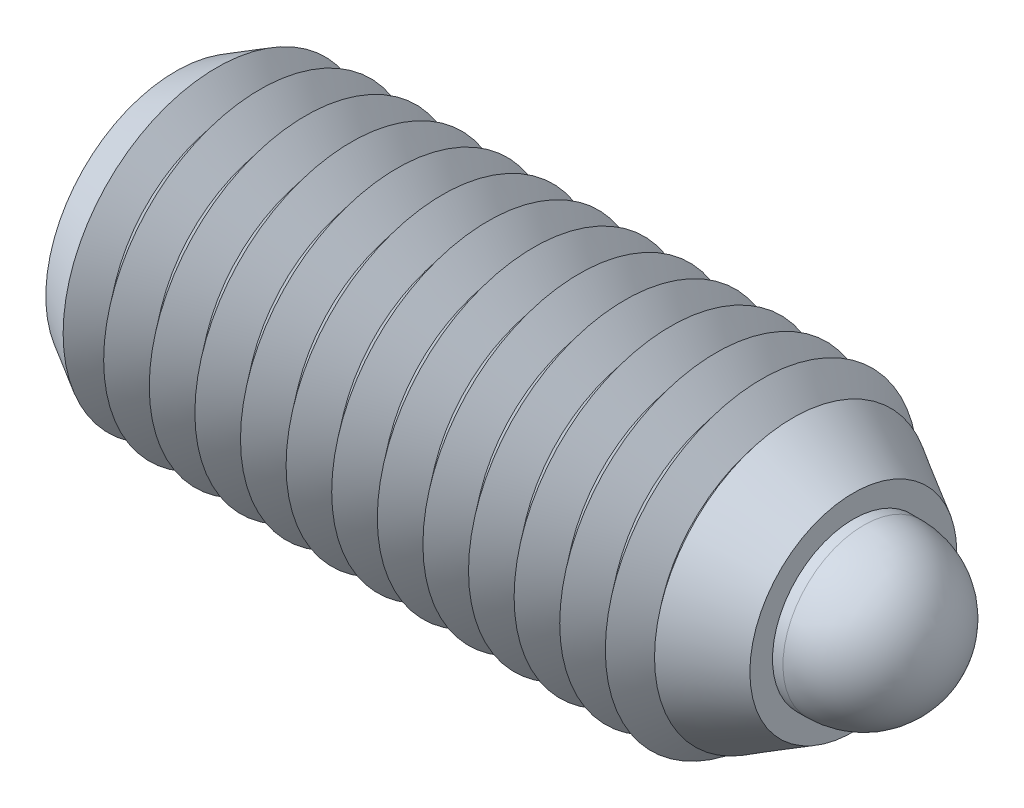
ISO-10303-21;
HEADER;
FILE_DESCRIPTION(('STEP AP214'),'2;1');
FILE_NAME('part.step','',(''),(''),'','','');
FILE_SCHEMA(('AUTOMOTIVE_DESIGN { 1 0 10303 214 1 1 1 1 }'));
ENDSEC;
DATA;
#1=APPLICATION_CONTEXT('core data for automotive mechanical design processes');
#2=APPLICATION_PROTOCOL_DEFINITION('international standard','automotive_design',2000,#1);
#3=PRODUCT_CONTEXT('',#1,'mechanical');
#4=PRODUCT('Part','Part','',(#3));
#5=PRODUCT_RELATED_PRODUCT_CATEGORY('part','',(#4));
#6=PRODUCT_DEFINITION_FORMATION('','',#4);
#7=PRODUCT_DEFINITION_CONTEXT('part definition',#1,'design');
#8=PRODUCT_DEFINITION('design','',#6,#7);
#9=PRODUCT_DEFINITION_SHAPE('','',#8);
#10=(LENGTH_UNIT() NAMED_UNIT(*) SI_UNIT(.MILLI.,.METRE.));
#11=(NAMED_UNIT(*) PLANE_ANGLE_UNIT() SI_UNIT($,.RADIAN.));
#12=(NAMED_UNIT(*) SI_UNIT($,.STERADIAN.) SOLID_ANGLE_UNIT());
#13=UNCERTAINTY_MEASURE_WITH_UNIT(LENGTH_MEASURE(1.E-05),#10,'distance_accuracy_value','');
#14=(GEOMETRIC_REPRESENTATION_CONTEXT(3) GLOBAL_UNCERTAINTY_ASSIGNED_CONTEXT((#13)) GLOBAL_UNIT_ASSIGNED_CONTEXT((#10,
#11,#12)) REPRESENTATION_CONTEXT('',''));
#15=CARTESIAN_POINT('',(0.,0.,0.));
#16=DIRECTION('',(0.,0.,1.));
#17=DIRECTION('',(1.,0.,0.));
#18=AXIS2_PLACEMENT_3D('',#15,#16,#17);
#19=CARTESIAN_POINT('',(24.3,0.,0.));
#20=DIRECTION('',(-1.,0.,0.));
#21=DIRECTION('',(0.,0.,1.));
#22=AXIS2_PLACEMENT_3D('',#19,#20,#21);
#23=CYLINDRICAL_SURFACE('',#22,4.34);
#24=CARTESIAN_POINT('',(20.14,0.,0.));
#25=DIRECTION('',(1.,0.,0.));
#26=DIRECTION('',(0.,0.,-1.));
#27=AXIS2_PLACEMENT_3D('',#24,#25,#26);
#28=CIRCLE('',#27,4.34);
#29=CARTESIAN_POINT('',(20.14,0.,-4.34));
#30=VERTEX_POINT('',#29);
#31=EDGE_CURVE('P0_E21',#30,#30,#28,.T.);
#32=ORIENTED_EDGE('',*,*,#31,.T.);
#33=EDGE_LOOP('',(#32));
#34=FACE_BOUND('',#33,.T.);
#35=CARTESIAN_POINT('',(23.06,0.,0.));
#36=DIRECTION('',(1.,0.,0.));
#37=DIRECTION('',(0.,0.,-1.));
#38=AXIS2_PLACEMENT_3D('',#35,#36,#37);
#39=CIRCLE('',#38,4.34);
#40=CARTESIAN_POINT('',(23.06,0.,-4.34));
#41=VERTEX_POINT('',#40);
#42=EDGE_CURVE('P0_E25',#41,#41,#39,.F.);
#43=ORIENTED_EDGE('',*,*,#42,.T.);
#44=EDGE_LOOP('',(#43));
#45=FACE_BOUND('',#44,.T.);
#46=ADVANCED_FACE('P0_F14',(#34,#45),#23,.T.);
#47=CARTESIAN_POINT('',(19.1,0.,0.));
#48=DIRECTION('',(1.,0.,0.));
#49=DIRECTION('',(0.,0.,-1.));
#50=AXIS2_PLACEMENT_3D('',#47,#48,#49);
#51=PLANE('',#50);
#52=CARTESIAN_POINT('',(19.1,0.,0.));
#53=DIRECTION('',(1.,0.,0.));
#54=DIRECTION('',(0.,0.,-1.));
#55=AXIS2_PLACEMENT_3D('',#52,#53,#54);
#56=CIRCLE('',#55,4.06133283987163);
#57=CARTESIAN_POINT('',(19.1,0.,-4.06133283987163));
#58=VERTEX_POINT('',#57);
#59=EDGE_CURVE('P0_E10',#58,#58,#56,.F.);
#60=ORIENTED_EDGE('',*,*,#59,.T.);
#61=EDGE_LOOP('',(#60));
#62=FACE_BOUND('',#61,.T.);
#63=ADVANCED_FACE('P0_F43',(#62),#51,.F.);
#64=CARTESIAN_POINT('',(26.4,0.,0.));
#65=DIRECTION('',(-1.,0.,0.));
#66=DIRECTION('',(0.,0.,1.));
#67=AXIS2_PLACEMENT_3D('',#64,#65,#66);
#68=CYLINDRICAL_SURFACE('',#67,3.1);
#69=CARTESIAN_POINT('',(26.4,0.,0.));
#70=DIRECTION('',(1.,0.,0.));
#71=DIRECTION('',(0.,0.,-1.));
#72=AXIS2_PLACEMENT_3D('',#69,#70,#71);
#73=CIRCLE('',#72,3.1);
#74=CARTESIAN_POINT('',(26.4,0.,-3.1));
#75=VERTEX_POINT('',#74);
#76=EDGE_CURVE('P0_E29',#75,#75,#73,.T.);
#77=ORIENTED_EDGE('',*,*,#76,.F.);
#78=EDGE_LOOP('',(#77));
#79=FACE_BOUND('',#78,.T.);
#80=CARTESIAN_POINT('',(24.3,0.,0.));
#81=DIRECTION('',(1.,0.,0.));
#82=DIRECTION('',(0.,0.,-1.));
#83=AXIS2_PLACEMENT_3D('',#80,#81,#82);
#84=CIRCLE('',#83,3.1);
#85=CARTESIAN_POINT('',(24.3,0.,-3.1));
#86=VERTEX_POINT('',#85);
#87=EDGE_CURVE('P0_E32',#86,#86,#84,.T.);
#88=ORIENTED_EDGE('',*,*,#87,.T.);
#89=EDGE_LOOP('',(#88));
#90=FACE_BOUND('',#89,.T.);
#91=ADVANCED_FACE('P0_F40',(#79,#90),#68,.T.);
#92=CARTESIAN_POINT('',(26.4,0.,0.));
#93=DIRECTION('',(-1.,0.,0.));
#94=DIRECTION('',(0.,1.,0.));
#95=AXIS2_PLACEMENT_3D('',#92,#93,#94);
#96=SPHERICAL_SURFACE('',#95,3.1);
#97=ORIENTED_EDGE('',*,*,#76,.T.);
#98=EDGE_LOOP('',(#97));
#99=FACE_BOUND('',#98,.T.);
#100=ADVANCED_FACE('P0_F38',(#99),#96,.T.);
#101=CARTESIAN_POINT('',(24.3,0.,0.));
#102=DIRECTION('',(-1.,0.,0.));
#103=DIRECTION('',(0.,0.,1.));
#104=AXIS2_PLACEMENT_3D('',#101,#102,#103);
#105=CONICAL_SURFACE('',#104,3.1,0.785398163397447);
#106=ORIENTED_EDGE('',*,*,#42,.F.);
#107=EDGE_LOOP('',(#106));
#108=FACE_BOUND('',#107,.T.);
#109=ORIENTED_EDGE('',*,*,#87,.F.);
#110=EDGE_LOOP('',(#109));
#111=FACE_BOUND('',#110,.T.);
#112=ADVANCED_FACE('P0_F47',(#108,#111),#105,.T.);
#113=CARTESIAN_POINT('',(20.14,0.,0.));
#114=DIRECTION('',(1.,0.,0.));
#115=DIRECTION('',(0.,0.,-1.));
#116=AXIS2_PLACEMENT_3D('',#113,#114,#115);
#117=CONICAL_SURFACE('',#116,4.34,0.261799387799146);
#118=ORIENTED_EDGE('',*,*,#59,.F.);
#119=EDGE_LOOP('',(#118));
#120=FACE_BOUND('',#119,.T.);
#121=ORIENTED_EDGE('',*,*,#31,.F.);
#122=EDGE_LOOP('',(#121));
#123=FACE_BOUND('',#122,.T.);
#124=ADVANCED_FACE('P0_F16',(#120,#123),#117,.T.);
#125=CLOSED_SHELL('',(#46,#63,#91,#100,#112,#124));
#126=MANIFOLD_SOLID_BREP('P0_B1',#125);
#127=CARTESIAN_POINT('',(26.,0.,0.));
#128=DIRECTION('',(-1.,0.,0.));
#129=DIRECTION('',(0.,0.,1.));
#130=AXIS2_PLACEMENT_3D('',#127,#128,#129);
#131=CONICAL_SURFACE('',#130,3.96999999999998,0.5235987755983);
#132=CARTESIAN_POINT('',(26.,0.,0.));
#133=DIRECTION('',(1.,0.,0.));
#134=DIRECTION('',(0.,0.,-1.));
#135=AXIS2_PLACEMENT_3D('',#132,#133,#134);
#136=CIRCLE('',#135,3.96999999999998);
#137=CARTESIAN_POINT('',(26.,0.,3.96999999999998));
#138=VERTEX_POINT('',#137);
#139=EDGE_CURVE('P1_E326',#138,#138,#136,.T.);
#140=CARTESIAN_POINT('',(23.6807225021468,0.,0.));
#141=DIRECTION('',(1.,0.,0.));
#142=DIRECTION('',(0.,0.,-1.));
#143=AXIS2_PLACEMENT_3D('',#140,#141,#142);
#144=CIRCLE('',#143,5.30903548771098);
#145=CARTESIAN_POINT('',(23.6807225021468,0.,5.30903548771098));
#146=VERTEX_POINT('',#145);
#147=EDGE_CURVE('P1_E330',#146,#146,#144,.T.);
#148=CARTESIAN_POINT('',(26.,0.,3.96999999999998));
#149=CARTESIAN_POINT('',(25.9758408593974,0.,3.9839482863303));
#150=CARTESIAN_POINT('',(25.9516817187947,0.,3.99789657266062));
#151=CARTESIAN_POINT('',(25.9033634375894,0.,4.02579314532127));
#152=CARTESIAN_POINT('',(25.8792042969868,0.,4.03974143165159));
#153=CARTESIAN_POINT('',(25.8308860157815,0.,4.06763800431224));
#154=CARTESIAN_POINT('',(25.8067268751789,0.,4.08158629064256));
#155=CARTESIAN_POINT('',(25.7584085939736,0.,4.10948286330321));
#156=CARTESIAN_POINT('',(25.734249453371,0.,4.12343114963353));
#157=CARTESIAN_POINT('',(25.6859311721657,0.,4.15132772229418));
#158=CARTESIAN_POINT('',(25.6617720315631,0.,4.1652760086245));
#159=CARTESIAN_POINT('',(25.6134537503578,0.,4.19317258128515));
#160=CARTESIAN_POINT('',(25.5892946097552,0.,4.20712086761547));
#161=CARTESIAN_POINT('',(25.5409763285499,0.,4.23501744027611));
#162=CARTESIAN_POINT('',(25.5168171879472,0.,4.24896572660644));
#163=CARTESIAN_POINT('',(25.468498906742,0.,4.27686229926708));
#164=CARTESIAN_POINT('',(25.4443397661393,0.,4.29081058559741));
#165=CARTESIAN_POINT('',(25.3960214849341,0.,4.31870715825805));
#166=CARTESIAN_POINT('',(25.3718623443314,0.,4.33265544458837));
#167=CARTESIAN_POINT('',(25.3235440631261,0.,4.36055201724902));
#168=CARTESIAN_POINT('',(25.2993849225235,0.,4.37450030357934));
#169=CARTESIAN_POINT('',(25.2510666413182,0.,4.40239687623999));
#170=CARTESIAN_POINT('',(25.2269075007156,0.,4.41634516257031));
#171=CARTESIAN_POINT('',(25.1785892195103,0.,4.44424173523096));
#172=CARTESIAN_POINT('',(25.1544300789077,0.,4.45819002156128));
#173=CARTESIAN_POINT('',(25.1061117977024,0.,4.48608659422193));
#174=CARTESIAN_POINT('',(25.0819526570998,0.,4.50003488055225));
#175=CARTESIAN_POINT('',(25.0336343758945,0.,4.5279314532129));
#176=CARTESIAN_POINT('',(25.0094752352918,0.,4.54187973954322));
#177=CARTESIAN_POINT('',(24.9611569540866,0.,4.56977631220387));
#178=CARTESIAN_POINT('',(24.9369978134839,0.,4.58372459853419));
#179=CARTESIAN_POINT('',(24.8886795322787,0.,4.61162117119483));
#180=CARTESIAN_POINT('',(24.864520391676,0.,4.62556945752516));
#181=CARTESIAN_POINT('',(24.8162021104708,0.,4.6534660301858));
#182=CARTESIAN_POINT('',(24.7920429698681,0.,4.66741431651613));
#183=CARTESIAN_POINT('',(24.7437246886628,0.,4.69531088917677));
#184=CARTESIAN_POINT('',(24.7195655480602,0.,4.70925917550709));
#185=CARTESIAN_POINT('',(24.6712472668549,0.,4.73715574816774));
#186=CARTESIAN_POINT('',(24.6470881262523,0.,4.75110403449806));
#187=CARTESIAN_POINT('',(24.598769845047,0.,4.77900060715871));
#188=CARTESIAN_POINT('',(24.5746107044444,0.,4.79294889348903));
#189=CARTESIAN_POINT('',(24.5262924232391,0.,4.82084546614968));
#190=CARTESIAN_POINT('',(24.5021332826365,0.,4.83479375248));
#191=CARTESIAN_POINT('',(24.4538150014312,0.,4.86269032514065));
#192=CARTESIAN_POINT('',(24.4296558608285,0.,4.87663861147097));
#193=CARTESIAN_POINT('',(24.3813375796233,0.,4.90453518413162));
#194=CARTESIAN_POINT('',(24.3571784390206,0.,4.91848347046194));
#195=CARTESIAN_POINT('',(24.3088601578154,0.,4.94638004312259));
#196=CARTESIAN_POINT('',(24.2847010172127,0.,4.96032832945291));
#197=CARTESIAN_POINT('',(24.2363827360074,0.,4.98822490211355));
#198=CARTESIAN_POINT('',(24.2122235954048,0.,5.00217318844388));
#199=CARTESIAN_POINT('',(24.1639053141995,0.,5.03006976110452));
#200=CARTESIAN_POINT('',(24.1397461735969,0.,5.04401804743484));
#201=CARTESIAN_POINT('',(24.0914278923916,0.,5.07191462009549));
#202=CARTESIAN_POINT('',(24.067268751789,0.,5.08586290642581));
#203=CARTESIAN_POINT('',(24.0189504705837,0.,5.11375947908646));
#204=CARTESIAN_POINT('',(23.9947913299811,0.,5.12770776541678));
#205=CARTESIAN_POINT('',(23.9464730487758,0.,5.15560433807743));
#206=CARTESIAN_POINT('',(23.9223139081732,0.,5.16955262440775));
#207=CARTESIAN_POINT('',(23.8739956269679,0.,5.1974491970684));
#208=CARTESIAN_POINT('',(23.8498364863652,0.,5.21139748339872));
#209=CARTESIAN_POINT('',(23.80151820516,0.,5.23929405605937));
#210=CARTESIAN_POINT('',(23.7773590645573,0.,5.25324234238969));
#211=CARTESIAN_POINT('',(23.7290407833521,0.,5.28113891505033));
#212=CARTESIAN_POINT('',(23.7048816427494,0.,5.29508720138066));
#213=CARTESIAN_POINT('',(23.6807225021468,0.,5.30903548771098));
#214=B_SPLINE_CURVE_WITH_KNOTS('',3,(#148,#149,#150,#151,#152,#153,#154,#155,#156,#157,#158,
#159,#160,#161,#162,#163,#164,#165,#166,#167,#168,#169,#170,#171,#172,#173,#174,#175,#176,#177,
#178,#179,#180,#181,#182,#183,#184,#185,#186,#187,#188,#189,#190,#191,#192,#193,#194,#195,#196,
#197,#198,#199,#200,#201,#202,#203,#204,#205,#206,#207,#208,#209,#210,#211,#212,#213),
.UNSPECIFIED.,.F.,.F.,(4,2,2,2,2,2,2,2,2,2,2,2,2,2,2,2,2,2,2,2,2,2,2,2,2,2,2,2,2,2,2,2,4),(0.,
0.0836897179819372,0.167379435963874,0.251069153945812,0.334758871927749,0.418448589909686,
0.502138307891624,0.585828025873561,0.669517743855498,0.753207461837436,0.836897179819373,
0.920586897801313,1.00427661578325,1.08796633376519,1.17165605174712,1.25534576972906,
1.339035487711,1.42272520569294,1.50641492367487,1.59010464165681,1.67379435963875,
1.75748407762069,1.84117379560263,1.92486351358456,2.0085532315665,2.09224294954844,
2.17593266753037,2.25962238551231,2.34331210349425,2.42700182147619,2.51069153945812,
2.59438125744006,2.678070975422),.UNSPECIFIED.);
#215=EDGE_CURVE('P1_BSEAM15',#138,#146,#214,.T.);
#216=ORIENTED_EDGE('',*,*,#139,.F.);
#217=ORIENTED_EDGE('',*,*,#147,.T.);
#218=ORIENTED_EDGE('',*,*,#215,.T.);
#219=ORIENTED_EDGE('',*,*,#215,.F.);
#220=EDGE_LOOP('',(#216,#218,#217,#219));
#221=FACE_BOUND('',#220,.T.);
#222=ADVANCED_FACE('P1_F15',(#221),#131,.T.);
#223=CARTESIAN_POINT('',(26.,0.,0.));
#224=DIRECTION('',(1.,0.,0.));
#225=DIRECTION('',(0.,0.,-1.));
#226=AXIS2_PLACEMENT_3D('',#223,#224,#225);
#227=PLANE('',#226);
#228=ORIENTED_EDGE('',*,*,#139,.T.);
#229=EDGE_LOOP('',(#228));
#230=FACE_BOUND('',#229,.T.);
#231=CARTESIAN_POINT('',(26.,0.,0.));
#232=DIRECTION('',(1.,0.,0.));
#233=DIRECTION('',(0.,0.,-1.));
#234=AXIS2_PLACEMENT_3D('',#231,#232,#233);
#235=CIRCLE('',#234,3.1);
#236=CARTESIAN_POINT('',(26.,0.,-3.1));
#237=VERTEX_POINT('',#236);
#238=EDGE_CURVE('P1_E333',#237,#237,#235,.T.);
#239=ORIENTED_EDGE('',*,*,#238,.F.);
#240=EDGE_LOOP('',(#239));
#241=FACE_BOUND('',#240,.T.);
#242=ADVANCED_FACE('P1_F188',(#230,#241),#227,.T.);
#243=CARTESIAN_POINT('',(7.8,0.,0.));
#244=DIRECTION('',(-1.,0.,0.));
#245=DIRECTION('',(0.,0.,1.));
#246=AXIS2_PLACEMENT_3D('',#243,#244,#245);
#247=PLANE('',#246);
#248=CARTESIAN_POINT('',(7.8,0.,0.));
#249=DIRECTION('',(1.,0.,0.));
#250=DIRECTION('',(0.,0.,-1.));
#251=AXIS2_PLACEMENT_3D('',#248,#249,#250);
#252=CIRCLE('',#251,4.34);
#253=CARTESIAN_POINT('',(7.8,0.,-4.34));
#254=VERTEX_POINT('',#253);
#255=EDGE_CURVE('P1_E416',#254,#254,#252,.T.);
#256=ORIENTED_EDGE('',*,*,#255,.T.);
#257=EDGE_LOOP('',(#256));
#258=FACE_BOUND('',#257,.T.);
#259=ADVANCED_FACE('P1_F194',(#258),#247,.F.);
#260=CARTESIAN_POINT('',(26.,0.,0.));
#261=DIRECTION('',(1.,0.,0.));
#262=DIRECTION('',(0.,0.,-1.));
#263=AXIS2_PLACEMENT_3D('',#260,#261,#262);
#264=CYLINDRICAL_SURFACE('',#263,4.34);
#265=ORIENTED_EDGE('',*,*,#255,.F.);
#266=EDGE_LOOP('',(#265));
#267=FACE_BOUND('',#266,.T.);
#268=CARTESIAN_POINT('',(23.4,0.,0.));
#269=DIRECTION('',(1.,0.,0.));
#270=DIRECTION('',(0.,0.,-1.));
#271=AXIS2_PLACEMENT_3D('',#268,#269,#270);
#272=CIRCLE('',#271,4.34);
#273=CARTESIAN_POINT('',(23.4,0.,-4.34));
#274=VERTEX_POINT('',#273);
#275=EDGE_CURVE('P1_E414',#274,#274,#272,.T.);
#276=ORIENTED_EDGE('',*,*,#275,.T.);
#277=EDGE_LOOP('',(#276));
#278=FACE_BOUND('',#277,.T.);
#279=ADVANCED_FACE('P1_F454',(#267,#278),#264,.F.);
#280=CARTESIAN_POINT('',(26.,0.,0.));
#281=DIRECTION('',(-1.,0.,0.));
#282=DIRECTION('',(0.,0.,1.));
#283=AXIS2_PLACEMENT_3D('',#280,#281,#282);
#284=CONICAL_SURFACE('',#283,3.1,0.445016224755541);
#285=ORIENTED_EDGE('',*,*,#275,.F.);
#286=EDGE_LOOP('',(#285));
#287=FACE_BOUND('',#286,.T.);
#288=ORIENTED_EDGE('',*,*,#238,.T.);
#289=EDGE_LOOP('',(#288));
#290=FACE_BOUND('',#289,.T.);
#291=ADVANCED_FACE('P1_F460',(#287,#290),#284,.F.);
#292=CARTESIAN_POINT('',(23.3589368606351,0.,0.));
#293=DIRECTION('',(1.,0.,0.));
#294=DIRECTION('',(0.,0.,-1.));
#295=AXIS2_PLACEMENT_3D('',#292,#293,#294);
#296=CONICAL_SURFACE('',#295,4.90712535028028,0.895664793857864);
#297=ORIENTED_EDGE('',*,*,#147,.F.);
#298=EDGE_LOOP('',(#297));
#299=FACE_BOUND('',#298,.T.);
#300=CARTESIAN_POINT('',(23.3589368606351,0.,0.));
#301=DIRECTION('',(-1.,0.,0.));
#302=DIRECTION('',(0.,0.,1.));
#303=AXIS2_PLACEMENT_3D('',#300,#301,#302);
#304=CIRCLE('',#303,4.90712535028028);
#305=CARTESIAN_POINT('',(23.3589368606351,0.,4.90712535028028));
#306=VERTEX_POINT('',#305);
#307=EDGE_CURVE('P1_E334',#306,#306,#304,.T.);
#308=ORIENTED_EDGE('',*,*,#307,.F.);
#309=EDGE_LOOP('',(#308));
#310=FACE_BOUND('',#309,.T.);
#311=ADVANCED_FACE('P1_F467',(#299,#310),#296,.T.);
#312=CARTESIAN_POINT('',(22.4839368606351,0.,0.));
#313=DIRECTION('',(-1.,0.,0.));
#314=DIRECTION('',(0.,0.,1.));
#315=AXIS2_PLACEMENT_3D('',#312,#313,#314);
#316=CONICAL_SURFACE('',#315,6.,0.895664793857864);
#317=ORIENTED_EDGE('',*,*,#307,.T.);
#318=EDGE_LOOP('',(#317));
#319=FACE_BOUND('',#318,.T.);
#320=CARTESIAN_POINT('',(22.4839368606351,0.,0.));
#321=DIRECTION('',(-1.,0.,0.));
#322=DIRECTION('',(0.,0.,1.));
#323=AXIS2_PLACEMENT_3D('',#320,#321,#322);
#324=CIRCLE('',#323,6.);
#325=CARTESIAN_POINT('',(22.4839368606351,0.,6.));
#326=VERTEX_POINT('',#325);
#327=EDGE_CURVE('P1_E407',#326,#326,#324,.T.);
#328=ORIENTED_EDGE('',*,*,#327,.F.);
#329=EDGE_LOOP('',(#328));
#330=FACE_BOUND('',#329,.T.);
#331=ADVANCED_FACE('P1_F475',(#319,#330),#316,.T.);
#332=CARTESIAN_POINT('',(21.6089368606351,0.,0.));
#333=DIRECTION('',(1.,0.,0.));
#334=DIRECTION('',(0.,0.,-1.));
#335=AXIS2_PLACEMENT_3D('',#332,#333,#334);
#336=CONICAL_SURFACE('',#335,4.90712535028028,0.895664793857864);
#337=ORIENTED_EDGE('',*,*,#327,.T.);
#338=EDGE_LOOP('',(#337));
#339=FACE_BOUND('',#338,.T.);
#340=CARTESIAN_POINT('',(21.6089368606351,0.,0.));
#341=DIRECTION('',(-1.,0.,0.));
#342=DIRECTION('',(0.,0.,1.));
#343=AXIS2_PLACEMENT_3D('',#340,#341,#342);
#344=CIRCLE('',#343,4.90712535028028);
#345=CARTESIAN_POINT('',(21.6089368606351,0.,4.90712535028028));
#346=VERTEX_POINT('',#345);
#347=EDGE_CURVE('P1_E404',#346,#346,#344,.T.);
#348=ORIENTED_EDGE('',*,*,#347,.F.);
#349=EDGE_LOOP('',(#348));
#350=FACE_BOUND('',#349,.T.);
#351=ADVANCED_FACE('P1_F483',(#339,#350),#336,.T.);
#352=CARTESIAN_POINT('',(20.7339368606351,0.,0.));
#353=DIRECTION('',(-1.,0.,0.));
#354=DIRECTION('',(0.,0.,1.));
#355=AXIS2_PLACEMENT_3D('',#352,#353,#354);
#356=CONICAL_SURFACE('',#355,6.,0.895664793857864);
#357=ORIENTED_EDGE('',*,*,#347,.T.);
#358=EDGE_LOOP('',(#357));
#359=FACE_BOUND('',#358,.T.);
#360=CARTESIAN_POINT('',(20.7339368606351,0.,0.));
#361=DIRECTION('',(-1.,0.,0.));
#362=DIRECTION('',(0.,0.,1.));
#363=AXIS2_PLACEMENT_3D('',#360,#361,#362);
#364=CIRCLE('',#363,6.);
#365=CARTESIAN_POINT('',(20.7339368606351,0.,6.));
#366=VERTEX_POINT('',#365);
#367=EDGE_CURVE('P1_E401',#366,#366,#364,.T.);
#368=ORIENTED_EDGE('',*,*,#367,.F.);
#369=EDGE_LOOP('',(#368));
#370=FACE_BOUND('',#369,.T.);
#371=ADVANCED_FACE('P1_F491',(#359,#370),#356,.T.);
#372=CARTESIAN_POINT('',(19.8589368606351,0.,0.));
#373=DIRECTION('',(1.,0.,0.));
#374=DIRECTION('',(0.,0.,-1.));
#375=AXIS2_PLACEMENT_3D('',#372,#373,#374);
#376=CONICAL_SURFACE('',#375,4.90712535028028,0.895664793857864);
#377=ORIENTED_EDGE('',*,*,#367,.T.);
#378=EDGE_LOOP('',(#377));
#379=FACE_BOUND('',#378,.T.);
#380=CARTESIAN_POINT('',(19.8589368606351,0.,0.));
#381=DIRECTION('',(-1.,0.,0.));
#382=DIRECTION('',(0.,0.,1.));
#383=AXIS2_PLACEMENT_3D('',#380,#381,#382);
#384=CIRCLE('',#383,4.90712535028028);
#385=CARTESIAN_POINT('',(19.8589368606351,0.,4.90712535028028));
#386=VERTEX_POINT('',#385);
#387=EDGE_CURVE('P1_E398',#386,#386,#384,.T.);
#388=ORIENTED_EDGE('',*,*,#387,.F.);
#389=EDGE_LOOP('',(#388));
#390=FACE_BOUND('',#389,.T.);
#391=ADVANCED_FACE('P1_F499',(#379,#390),#376,.T.);
#392=CARTESIAN_POINT('',(18.9839368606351,0.,0.));
#393=DIRECTION('',(-1.,0.,0.));
#394=DIRECTION('',(0.,0.,1.));
#395=AXIS2_PLACEMENT_3D('',#392,#393,#394);
#396=CONICAL_SURFACE('',#395,6.,0.895664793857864);
#397=ORIENTED_EDGE('',*,*,#387,.T.);
#398=EDGE_LOOP('',(#397));
#399=FACE_BOUND('',#398,.T.);
#400=CARTESIAN_POINT('',(18.9839368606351,0.,0.));
#401=DIRECTION('',(-1.,0.,0.));
#402=DIRECTION('',(0.,0.,1.));
#403=AXIS2_PLACEMENT_3D('',#400,#401,#402);
#404=CIRCLE('',#403,6.);
#405=CARTESIAN_POINT('',(18.9839368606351,0.,6.));
#406=VERTEX_POINT('',#405);
#407=EDGE_CURVE('P1_E395',#406,#406,#404,.T.);
#408=ORIENTED_EDGE('',*,*,#407,.F.);
#409=EDGE_LOOP('',(#408));
#410=FACE_BOUND('',#409,.T.);
#411=ADVANCED_FACE('P1_F507',(#399,#410),#396,.T.);
#412=CARTESIAN_POINT('',(18.1089368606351,0.,0.));
#413=DIRECTION('',(1.,0.,0.));
#414=DIRECTION('',(0.,0.,-1.));
#415=AXIS2_PLACEMENT_3D('',#412,#413,#414);
#416=CONICAL_SURFACE('',#415,4.90712535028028,0.895664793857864);
#417=ORIENTED_EDGE('',*,*,#407,.T.);
#418=EDGE_LOOP('',(#417));
#419=FACE_BOUND('',#418,.T.);
#420=CARTESIAN_POINT('',(18.1089368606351,0.,0.));
#421=DIRECTION('',(-1.,0.,0.));
#422=DIRECTION('',(0.,0.,1.));
#423=AXIS2_PLACEMENT_3D('',#420,#421,#422);
#424=CIRCLE('',#423,4.90712535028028);
#425=CARTESIAN_POINT('',(18.1089368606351,0.,4.90712535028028));
#426=VERTEX_POINT('',#425);
#427=EDGE_CURVE('P1_E392',#426,#426,#424,.T.);
#428=ORIENTED_EDGE('',*,*,#427,.F.);
#429=EDGE_LOOP('',(#428));
#430=FACE_BOUND('',#429,.T.);
#431=ADVANCED_FACE('P1_F515',(#419,#430),#416,.T.);
#432=CARTESIAN_POINT('',(17.2339368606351,0.,0.));
#433=DIRECTION('',(-1.,0.,0.));
#434=DIRECTION('',(0.,0.,1.));
#435=AXIS2_PLACEMENT_3D('',#432,#433,#434);
#436=CONICAL_SURFACE('',#435,6.,0.895664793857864);
#437=ORIENTED_EDGE('',*,*,#427,.T.);
#438=EDGE_LOOP('',(#437));
#439=FACE_BOUND('',#438,.T.);
#440=CARTESIAN_POINT('',(17.2339368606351,0.,0.));
#441=DIRECTION('',(-1.,0.,0.));
#442=DIRECTION('',(0.,0.,1.));
#443=AXIS2_PLACEMENT_3D('',#440,#441,#442);
#444=CIRCLE('',#443,6.);
#445=CARTESIAN_POINT('',(17.2339368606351,0.,6.));
#446=VERTEX_POINT('',#445);
#447=EDGE_CURVE('P1_E389',#446,#446,#444,.T.);
#448=ORIENTED_EDGE('',*,*,#447,.F.);
#449=EDGE_LOOP('',(#448));
#450=FACE_BOUND('',#449,.T.);
#451=ADVANCED_FACE('P1_F523',(#439,#450),#436,.T.);
#452=CARTESIAN_POINT('',(16.3589368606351,0.,0.));
#453=DIRECTION('',(1.,0.,0.));
#454=DIRECTION('',(0.,0.,-1.));
#455=AXIS2_PLACEMENT_3D('',#452,#453,#454);
#456=CONICAL_SURFACE('',#455,4.90712535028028,0.895664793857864);
#457=ORIENTED_EDGE('',*,*,#447,.T.);
#458=EDGE_LOOP('',(#457));
#459=FACE_BOUND('',#458,.T.);
#460=CARTESIAN_POINT('',(16.3589368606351,0.,0.));
#461=DIRECTION('',(-1.,0.,0.));
#462=DIRECTION('',(0.,0.,1.));
#463=AXIS2_PLACEMENT_3D('',#460,#461,#462);
#464=CIRCLE('',#463,4.90712535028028);
#465=CARTESIAN_POINT('',(16.3589368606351,0.,4.90712535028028));
#466=VERTEX_POINT('',#465);
#467=EDGE_CURVE('P1_E386',#466,#466,#464,.T.);
#468=ORIENTED_EDGE('',*,*,#467,.F.);
#469=EDGE_LOOP('',(#468));
#470=FACE_BOUND('',#469,.T.);
#471=ADVANCED_FACE('P1_F531',(#459,#470),#456,.T.);
#472=CARTESIAN_POINT('',(15.4839368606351,0.,0.));
#473=DIRECTION('',(-1.,0.,0.));
#474=DIRECTION('',(0.,0.,1.));
#475=AXIS2_PLACEMENT_3D('',#472,#473,#474);
#476=CONICAL_SURFACE('',#475,6.,0.895664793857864);
#477=ORIENTED_EDGE('',*,*,#467,.T.);
#478=EDGE_LOOP('',(#477));
#479=FACE_BOUND('',#478,.T.);
#480=CARTESIAN_POINT('',(15.4839368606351,0.,0.));
#481=DIRECTION('',(-1.,0.,0.));
#482=DIRECTION('',(0.,0.,1.));
#483=AXIS2_PLACEMENT_3D('',#480,#481,#482);
#484=CIRCLE('',#483,6.);
#485=CARTESIAN_POINT('',(15.4839368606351,0.,6.));
#486=VERTEX_POINT('',#485);
#487=EDGE_CURVE('P1_E383',#486,#486,#484,.T.);
#488=ORIENTED_EDGE('',*,*,#487,.F.);
#489=EDGE_LOOP('',(#488));
#490=FACE_BOUND('',#489,.T.);
#491=ADVANCED_FACE('P1_F539',(#479,#490),#476,.T.);
#492=CARTESIAN_POINT('',(14.6089368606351,0.,0.));
#493=DIRECTION('',(1.,0.,0.));
#494=DIRECTION('',(0.,0.,-1.));
#495=AXIS2_PLACEMENT_3D('',#492,#493,#494);
#496=CONICAL_SURFACE('',#495,4.90712535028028,0.895664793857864);
#497=ORIENTED_EDGE('',*,*,#487,.T.);
#498=EDGE_LOOP('',(#497));
#499=FACE_BOUND('',#498,.T.);
#500=CARTESIAN_POINT('',(14.6089368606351,0.,0.));
#501=DIRECTION('',(-1.,0.,0.));
#502=DIRECTION('',(0.,0.,1.));
#503=AXIS2_PLACEMENT_3D('',#500,#501,#502);
#504=CIRCLE('',#503,4.90712535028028);
#505=CARTESIAN_POINT('',(14.6089368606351,0.,4.90712535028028));
#506=VERTEX_POINT('',#505);
#507=EDGE_CURVE('P1_E380',#506,#506,#504,.T.);
#508=ORIENTED_EDGE('',*,*,#507,.F.);
#509=EDGE_LOOP('',(#508));
#510=FACE_BOUND('',#509,.T.);
#511=ADVANCED_FACE('P1_F547',(#499,#510),#496,.T.);
#512=CARTESIAN_POINT('',(13.7339368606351,0.,0.));
#513=DIRECTION('',(-1.,0.,0.));
#514=DIRECTION('',(0.,0.,1.));
#515=AXIS2_PLACEMENT_3D('',#512,#513,#514);
#516=CONICAL_SURFACE('',#515,6.,0.895664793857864);
#517=ORIENTED_EDGE('',*,*,#507,.T.);
#518=EDGE_LOOP('',(#517));
#519=FACE_BOUND('',#518,.T.);
#520=CARTESIAN_POINT('',(13.7339368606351,0.,0.));
#521=DIRECTION('',(-1.,0.,0.));
#522=DIRECTION('',(0.,0.,1.));
#523=AXIS2_PLACEMENT_3D('',#520,#521,#522);
#524=CIRCLE('',#523,6.);
#525=CARTESIAN_POINT('',(13.7339368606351,0.,6.));
#526=VERTEX_POINT('',#525);
#527=EDGE_CURVE('P1_E377',#526,#526,#524,.T.);
#528=ORIENTED_EDGE('',*,*,#527,.F.);
#529=EDGE_LOOP('',(#528));
#530=FACE_BOUND('',#529,.T.);
#531=ADVANCED_FACE('P1_F555',(#519,#530),#516,.T.);
#532=CARTESIAN_POINT('',(12.8589368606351,0.,0.));
#533=DIRECTION('',(1.,0.,0.));
#534=DIRECTION('',(0.,0.,-1.));
#535=AXIS2_PLACEMENT_3D('',#532,#533,#534);
#536=CONICAL_SURFACE('',#535,4.90712535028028,0.895664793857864);
#537=ORIENTED_EDGE('',*,*,#527,.T.);
#538=EDGE_LOOP('',(#537));
#539=FACE_BOUND('',#538,.T.);
#540=CARTESIAN_POINT('',(12.8589368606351,0.,0.));
#541=DIRECTION('',(-1.,0.,0.));
#542=DIRECTION('',(0.,0.,1.));
#543=AXIS2_PLACEMENT_3D('',#540,#541,#542);
#544=CIRCLE('',#543,4.90712535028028);
#545=CARTESIAN_POINT('',(12.8589368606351,0.,4.90712535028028));
#546=VERTEX_POINT('',#545);
#547=EDGE_CURVE('P1_E374',#546,#546,#544,.T.);
#548=ORIENTED_EDGE('',*,*,#547,.F.);
#549=EDGE_LOOP('',(#548));
#550=FACE_BOUND('',#549,.T.);
#551=ADVANCED_FACE('P1_F563',(#539,#550),#536,.T.);
#552=CARTESIAN_POINT('',(11.9839368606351,0.,0.));
#553=DIRECTION('',(-1.,0.,0.));
#554=DIRECTION('',(0.,0.,1.));
#555=AXIS2_PLACEMENT_3D('',#552,#553,#554);
#556=CONICAL_SURFACE('',#555,6.,0.895664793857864);
#557=ORIENTED_EDGE('',*,*,#547,.T.);
#558=EDGE_LOOP('',(#557));
#559=FACE_BOUND('',#558,.T.);
#560=CARTESIAN_POINT('',(11.9839368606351,0.,0.));
#561=DIRECTION('',(-1.,0.,0.));
#562=DIRECTION('',(0.,0.,1.));
#563=AXIS2_PLACEMENT_3D('',#560,#561,#562);
#564=CIRCLE('',#563,6.);
#565=CARTESIAN_POINT('',(11.9839368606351,0.,6.));
#566=VERTEX_POINT('',#565);
#567=EDGE_CURVE('P1_E371',#566,#566,#564,.T.);
#568=ORIENTED_EDGE('',*,*,#567,.F.);
#569=EDGE_LOOP('',(#568));
#570=FACE_BOUND('',#569,.T.);
#571=ADVANCED_FACE('P1_F571',(#559,#570),#556,.T.);
#572=CARTESIAN_POINT('',(11.1089368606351,0.,0.));
#573=DIRECTION('',(1.,0.,0.));
#574=DIRECTION('',(0.,0.,-1.));
#575=AXIS2_PLACEMENT_3D('',#572,#573,#574);
#576=CONICAL_SURFACE('',#575,4.90712535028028,0.895664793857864);
#577=ORIENTED_EDGE('',*,*,#567,.T.);
#578=EDGE_LOOP('',(#577));
#579=FACE_BOUND('',#578,.T.);
#580=CARTESIAN_POINT('',(11.1089368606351,0.,0.));
#581=DIRECTION('',(-1.,0.,0.));
#582=DIRECTION('',(0.,0.,1.));
#583=AXIS2_PLACEMENT_3D('',#580,#581,#582);
#584=CIRCLE('',#583,4.90712535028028);
#585=CARTESIAN_POINT('',(11.1089368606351,0.,4.90712535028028));
#586=VERTEX_POINT('',#585);
#587=EDGE_CURVE('P1_E368',#586,#586,#584,.T.);
#588=ORIENTED_EDGE('',*,*,#587,.F.);
#589=EDGE_LOOP('',(#588));
#590=FACE_BOUND('',#589,.T.);
#591=ADVANCED_FACE('P1_F579',(#579,#590),#576,.T.);
#592=CARTESIAN_POINT('',(10.2339368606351,0.,0.));
#593=DIRECTION('',(-1.,0.,0.));
#594=DIRECTION('',(0.,0.,1.));
#595=AXIS2_PLACEMENT_3D('',#592,#593,#594);
#596=CONICAL_SURFACE('',#595,6.,0.895664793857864);
#597=ORIENTED_EDGE('',*,*,#587,.T.);
#598=EDGE_LOOP('',(#597));
#599=FACE_BOUND('',#598,.T.);
#600=CARTESIAN_POINT('',(10.2339368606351,0.,0.));
#601=DIRECTION('',(-1.,0.,0.));
#602=DIRECTION('',(0.,0.,1.));
#603=AXIS2_PLACEMENT_3D('',#600,#601,#602);
#604=CIRCLE('',#603,6.);
#605=CARTESIAN_POINT('',(10.2339368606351,0.,6.));
#606=VERTEX_POINT('',#605);
#607=EDGE_CURVE('P1_E365',#606,#606,#604,.T.);
#608=ORIENTED_EDGE('',*,*,#607,.F.);
#609=EDGE_LOOP('',(#608));
#610=FACE_BOUND('',#609,.T.);
#611=ADVANCED_FACE('P1_F587',(#599,#610),#596,.T.);
#612=CARTESIAN_POINT('',(9.35893686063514,0.,0.));
#613=DIRECTION('',(1.,0.,0.));
#614=DIRECTION('',(0.,0.,-1.));
#615=AXIS2_PLACEMENT_3D('',#612,#613,#614);
#616=CONICAL_SURFACE('',#615,4.90712535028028,0.895664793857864);
#617=ORIENTED_EDGE('',*,*,#607,.T.);
#618=EDGE_LOOP('',(#617));
#619=FACE_BOUND('',#618,.T.);
#620=CARTESIAN_POINT('',(9.35893686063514,0.,0.));
#621=DIRECTION('',(-1.,0.,0.));
#622=DIRECTION('',(0.,0.,1.));
#623=AXIS2_PLACEMENT_3D('',#620,#621,#622);
#624=CIRCLE('',#623,4.90712535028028);
#625=CARTESIAN_POINT('',(9.35893686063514,0.,4.90712535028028));
#626=VERTEX_POINT('',#625);
#627=EDGE_CURVE('P1_E362',#626,#626,#624,.T.);
#628=ORIENTED_EDGE('',*,*,#627,.F.);
#629=EDGE_LOOP('',(#628));
#630=FACE_BOUND('',#629,.T.);
#631=ADVANCED_FACE('P1_F595',(#619,#630),#616,.T.);
#632=CARTESIAN_POINT('',(8.48393686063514,0.,0.));
#633=DIRECTION('',(-1.,0.,0.));
#634=DIRECTION('',(0.,0.,1.));
#635=AXIS2_PLACEMENT_3D('',#632,#633,#634);
#636=CONICAL_SURFACE('',#635,6.,0.895664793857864);
#637=ORIENTED_EDGE('',*,*,#627,.T.);
#638=EDGE_LOOP('',(#637));
#639=FACE_BOUND('',#638,.T.);
#640=CARTESIAN_POINT('',(8.48393686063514,0.,0.));
#641=DIRECTION('',(-1.,0.,0.));
#642=DIRECTION('',(0.,0.,1.));
#643=AXIS2_PLACEMENT_3D('',#640,#641,#642);
#644=CIRCLE('',#643,6.);
#645=CARTESIAN_POINT('',(8.48393686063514,0.,6.));
#646=VERTEX_POINT('',#645);
#647=EDGE_CURVE('P1_E359',#646,#646,#644,.T.);
#648=ORIENTED_EDGE('',*,*,#647,.F.);
#649=EDGE_LOOP('',(#648));
#650=FACE_BOUND('',#649,.T.);
#651=ADVANCED_FACE('P1_F603',(#639,#650),#636,.T.);
#652=CARTESIAN_POINT('',(7.60893686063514,0.,0.));
#653=DIRECTION('',(1.,0.,0.));
#654=DIRECTION('',(0.,0.,-1.));
#655=AXIS2_PLACEMENT_3D('',#652,#653,#654);
#656=CONICAL_SURFACE('',#655,4.90712535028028,0.895664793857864);
#657=ORIENTED_EDGE('',*,*,#647,.T.);
#658=EDGE_LOOP('',(#657));
#659=FACE_BOUND('',#658,.T.);
#660=CARTESIAN_POINT('',(7.60893686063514,0.,0.));
#661=DIRECTION('',(-1.,0.,0.));
#662=DIRECTION('',(0.,0.,1.));
#663=AXIS2_PLACEMENT_3D('',#660,#661,#662);
#664=CIRCLE('',#663,4.90712535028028);
#665=CARTESIAN_POINT('',(7.60893686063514,0.,4.90712535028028));
#666=VERTEX_POINT('',#665);
#667=EDGE_CURVE('P1_E356',#666,#666,#664,.T.);
#668=ORIENTED_EDGE('',*,*,#667,.F.);
#669=EDGE_LOOP('',(#668));
#670=FACE_BOUND('',#669,.T.);
#671=ADVANCED_FACE('P1_F611',(#659,#670),#656,.T.);
#672=CARTESIAN_POINT('',(6.73393686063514,0.,0.));
#673=DIRECTION('',(-1.,0.,0.));
#674=DIRECTION('',(0.,0.,1.));
#675=AXIS2_PLACEMENT_3D('',#672,#673,#674);
#676=CONICAL_SURFACE('',#675,6.,0.895664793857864);
#677=ORIENTED_EDGE('',*,*,#667,.T.);
#678=EDGE_LOOP('',(#677));
#679=FACE_BOUND('',#678,.T.);
#680=CARTESIAN_POINT('',(6.73393686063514,0.,0.));
#681=DIRECTION('',(-1.,0.,0.));
#682=DIRECTION('',(0.,0.,1.));
#683=AXIS2_PLACEMENT_3D('',#680,#681,#682);
#684=CIRCLE('',#683,6.);
#685=CARTESIAN_POINT('',(6.73393686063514,0.,6.));
#686=VERTEX_POINT('',#685);
#687=EDGE_CURVE('P1_E353',#686,#686,#684,.T.);
#688=ORIENTED_EDGE('',*,*,#687,.F.);
#689=EDGE_LOOP('',(#688));
#690=FACE_BOUND('',#689,.T.);
#691=ADVANCED_FACE('P1_F619',(#679,#690),#676,.T.);
#692=CARTESIAN_POINT('',(5.85893686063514,0.,0.));
#693=DIRECTION('',(1.,0.,0.));
#694=DIRECTION('',(0.,0.,-1.));
#695=AXIS2_PLACEMENT_3D('',#692,#693,#694);
#696=CONICAL_SURFACE('',#695,4.90712535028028,0.895664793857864);
#697=ORIENTED_EDGE('',*,*,#687,.T.);
#698=EDGE_LOOP('',(#697));
#699=FACE_BOUND('',#698,.T.);
#700=CARTESIAN_POINT('',(5.85893686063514,0.,0.));
#701=DIRECTION('',(-1.,0.,0.));
#702=DIRECTION('',(0.,0.,1.));
#703=AXIS2_PLACEMENT_3D('',#700,#701,#702);
#704=CIRCLE('',#703,4.90712535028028);
#705=CARTESIAN_POINT('',(5.85893686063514,0.,4.90712535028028));
#706=VERTEX_POINT('',#705);
#707=EDGE_CURVE('P1_E350',#706,#706,#704,.T.);
#708=ORIENTED_EDGE('',*,*,#707,.F.);
#709=EDGE_LOOP('',(#708));
#710=FACE_BOUND('',#709,.T.);
#711=ADVANCED_FACE('P1_F627',(#699,#710),#696,.T.);
#712=CARTESIAN_POINT('',(4.98393686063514,0.,0.));
#713=DIRECTION('',(-1.,0.,0.));
#714=DIRECTION('',(0.,0.,1.));
#715=AXIS2_PLACEMENT_3D('',#712,#713,#714);
#716=CONICAL_SURFACE('',#715,6.,0.895664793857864);
#717=ORIENTED_EDGE('',*,*,#707,.T.);
#718=EDGE_LOOP('',(#717));
#719=FACE_BOUND('',#718,.T.);
#720=CARTESIAN_POINT('',(4.98393686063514,0.,0.));
#721=DIRECTION('',(-1.,0.,0.));
#722=DIRECTION('',(0.,0.,1.));
#723=AXIS2_PLACEMENT_3D('',#720,#721,#722);
#724=CIRCLE('',#723,6.);
#725=CARTESIAN_POINT('',(4.98393686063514,0.,6.));
#726=VERTEX_POINT('',#725);
#727=EDGE_CURVE('P1_E342',#726,#726,#724,.T.);
#728=ORIENTED_EDGE('',*,*,#727,.F.);
#729=EDGE_LOOP('',(#728));
#730=FACE_BOUND('',#729,.T.);
#731=ADVANCED_FACE('P1_F635',(#719,#730),#716,.T.);
#732=CARTESIAN_POINT('',(4.10893686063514,0.,0.));
#733=DIRECTION('',(1.,0.,0.));
#734=DIRECTION('',(0.,0.,-1.));
#735=AXIS2_PLACEMENT_3D('',#732,#733,#734);
#736=CONICAL_SURFACE('',#735,4.90712535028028,0.895664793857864);
#737=ORIENTED_EDGE('',*,*,#727,.T.);
#738=EDGE_LOOP('',(#737));
#739=FACE_BOUND('',#738,.T.);
#740=CARTESIAN_POINT('',(4.10893686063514,0.,0.));
#741=DIRECTION('',(-1.,0.,0.));
#742=DIRECTION('',(0.,0.,1.));
#743=AXIS2_PLACEMENT_3D('',#740,#741,#742);
#744=CIRCLE('',#743,4.90712535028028);
#745=CARTESIAN_POINT('',(4.10893686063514,0.,4.90712535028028));
#746=VERTEX_POINT('',#745);
#747=EDGE_CURVE('P1_E338',#746,#746,#744,.T.);
#748=ORIENTED_EDGE('',*,*,#747,.F.);
#749=EDGE_LOOP('',(#748));
#750=FACE_BOUND('',#749,.T.);
#751=ADVANCED_FACE('P1_F643',(#739,#750),#736,.T.);
#752=CARTESIAN_POINT('',(3.23393686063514,0.,0.));
#753=DIRECTION('',(-1.,0.,0.));
#754=DIRECTION('',(0.,0.,1.));
#755=AXIS2_PLACEMENT_3D('',#752,#753,#754);
#756=CONICAL_SURFACE('',#755,6.,0.895664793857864);
#757=ORIENTED_EDGE('',*,*,#747,.T.);
#758=EDGE_LOOP('',(#757));
#759=FACE_BOUND('',#758,.T.);
#760=CARTESIAN_POINT('',(3.23393686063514,0.,0.));
#761=DIRECTION('',(-1.,0.,0.));
#762=DIRECTION('',(0.,0.,1.));
#763=AXIS2_PLACEMENT_3D('',#760,#761,#762);
#764=CIRCLE('',#763,6.);
#765=CARTESIAN_POINT('',(3.23393686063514,0.,6.));
#766=VERTEX_POINT('',#765);
#767=EDGE_CURVE('P1_E126',#766,#766,#764,.T.);
#768=ORIENTED_EDGE('',*,*,#767,.F.);
#769=EDGE_LOOP('',(#768));
#770=FACE_BOUND('',#769,.T.);
#771=ADVANCED_FACE('P1_F651',(#759,#770),#756,.T.);
#772=CARTESIAN_POINT('',(2.35893686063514,0.,0.));
#773=DIRECTION('',(1.,0.,0.));
#774=DIRECTION('',(0.,0.,-1.));
#775=AXIS2_PLACEMENT_3D('',#772,#773,#774);
#776=CONICAL_SURFACE('',#775,4.90712535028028,0.895664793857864);
#777=ORIENTED_EDGE('',*,*,#767,.T.);
#778=EDGE_LOOP('',(#777));
#779=FACE_BOUND('',#778,.T.);
#780=CARTESIAN_POINT('',(2.35893686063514,0.,0.));
#781=DIRECTION('',(-1.,0.,0.));
#782=DIRECTION('',(0.,0.,1.));
#783=AXIS2_PLACEMENT_3D('',#780,#781,#782);
#784=CIRCLE('',#783,4.90712535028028);
#785=CARTESIAN_POINT('',(2.35893686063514,0.,4.90712535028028));
#786=VERTEX_POINT('',#785);
#787=EDGE_CURVE('P1_E123',#786,#786,#784,.T.);
#788=ORIENTED_EDGE('',*,*,#787,.F.);
#789=EDGE_LOOP('',(#788));
#790=FACE_BOUND('',#789,.T.);
#791=ADVANCED_FACE('P1_F659',(#779,#790),#776,.T.);
#792=CARTESIAN_POINT('',(1.48393686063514,0.,0.));
#793=DIRECTION('',(-1.,0.,0.));
#794=DIRECTION('',(0.,0.,1.));
#795=AXIS2_PLACEMENT_3D('',#792,#793,#794);
#796=CONICAL_SURFACE('',#795,6.,0.895664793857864);
#797=CARTESIAN_POINT('',(1.57058436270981,0.,0.));
#798=DIRECTION('',(-1.,0.,0.));
#799=DIRECTION('',(0.,0.,1.));
#800=AXIS2_PLACEMENT_3D('',#797,#798,#799);
#801=CIRCLE('',#800,5.8917773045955);
#802=CARTESIAN_POINT('',(1.57058436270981,0.,-5.8917773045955));
#803=VERTEX_POINT('',#802);
#804=EDGE_CURVE('P1_E336',#803,#803,#801,.T.);
#805=ORIENTED_EDGE('',*,*,#804,.F.);
#806=EDGE_LOOP('',(#805));
#807=FACE_BOUND('',#806,.T.);
#808=ORIENTED_EDGE('',*,*,#787,.T.);
#809=EDGE_LOOP('',(#808));
#810=FACE_BOUND('',#809,.T.);
#811=ADVANCED_FACE('P1_F145',(#807,#810),#796,.T.);
#812=CARTESIAN_POINT('',(0.,0.,0.));
#813=DIRECTION('',(1.,0.,0.));
#814=DIRECTION('',(0.,0.,-1.));
#815=AXIS2_PLACEMENT_3D('',#812,#813,#814);
#816=PLANE('',#815);
#817=CARTESIAN_POINT('',(0.,0.,0.));
#818=DIRECTION('',(1.,0.,0.));
#819=DIRECTION('',(0.,0.,-1.));
#820=AXIS2_PLACEMENT_3D('',#817,#818,#819);
#821=CIRCLE('',#820,4.98499999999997);
#822=CARTESIAN_POINT('',(0.,0.,-4.98499999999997));
#823=VERTEX_POINT('',#822);
#824=EDGE_CURVE('P1_E249',#823,#823,#821,.F.);
#825=ORIENTED_EDGE('',*,*,#824,.T.);
#826=EDGE_LOOP('',(#825));
#827=FACE_BOUND('',#826,.T.);
#828=CARTESIAN_POINT('',(0.,0.,0.));
#829=DIRECTION('',(1.,0.,0.));
#830=DIRECTION('',(0.,0.,-1.));
#831=AXIS2_PLACEMENT_3D('',#828,#829,#830);
#832=CIRCLE('',#831,3.46410161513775);
#833=CARTESIAN_POINT('',(0.,-1.73205080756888,-3.));
#834=VERTEX_POINT('',#833);
#835=CARTESIAN_POINT('',(0.,1.73205080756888,-3.));
#836=VERTEX_POINT('',#835);
#837=EDGE_CURVE('P1_E19',#834,#836,#832,.T.);
#838=ORIENTED_EDGE('',*,*,#837,.T.);
#839=CARTESIAN_POINT('',(0.,3.46410161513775,0.));
#840=VERTEX_POINT('',#839);
#841=EDGE_CURVE('P1_E10',#836,#840,#832,.T.);
#842=ORIENTED_EDGE('',*,*,#841,.T.);
#843=CARTESIAN_POINT('',(0.,0.,0.));
#844=DIRECTION('',(-1.,0.,0.));
#845=DIRECTION('',(0.,0.,1.));
#846=AXIS2_PLACEMENT_3D('',#843,#844,#845);
#847=CIRCLE('',#846,3.46410161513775);
#848=CARTESIAN_POINT('',(0.,1.73205080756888,3.));
#849=VERTEX_POINT('',#848);
#850=EDGE_CURVE('P1_E35',#849,#840,#847,.T.);
#851=ORIENTED_EDGE('',*,*,#850,.F.);
#852=CARTESIAN_POINT('',(0.,-1.73205080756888,3.));
#853=VERTEX_POINT('',#852);
#854=EDGE_CURVE('P1_E24',#849,#853,#832,.T.);
#855=ORIENTED_EDGE('',*,*,#854,.T.);
#856=CARTESIAN_POINT('',(0.,-3.46410161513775,0.));
#857=VERTEX_POINT('',#856);
#858=EDGE_CURVE('P1_E250',#853,#857,#832,.T.);
#859=ORIENTED_EDGE('',*,*,#858,.T.);
#860=EDGE_CURVE('P1_E245',#857,#834,#832,.T.);
#861=ORIENTED_EDGE('',*,*,#860,.T.);
#862=EDGE_LOOP('',(#838,#842,#851,#855,#859,#861));
#863=FACE_BOUND('',#862,.T.);
#864=ADVANCED_FACE('P1_F103',(#827,#863),#816,.F.);
#865=CARTESIAN_POINT('',(1.75803156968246,0.,0.));
#866=DIRECTION('',(1.,0.,0.));
#867=DIRECTION('',(0.,0.,-1.));
#868=AXIS2_PLACEMENT_3D('',#865,#866,#867);
#869=CONICAL_SURFACE('',#868,6.,0.5235987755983);
#870=CARTESIAN_POINT('',(0.,0.,-4.98499999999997));
#871=CARTESIAN_POINT('',(0.016360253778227,0.,-4.99444559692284));
#872=CARTESIAN_POINT('',(0.0327205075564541,0.,-5.00389119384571));
#873=CARTESIAN_POINT('',(0.0654410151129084,0.,-5.02278238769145));
#874=CARTESIAN_POINT('',(0.0818012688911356,0.,-5.03222798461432));
#875=CARTESIAN_POINT('',(0.11452177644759,0.,-5.05111917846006));
#876=CARTESIAN_POINT('',(0.130882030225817,0.,-5.06056477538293));
#877=CARTESIAN_POINT('',(0.163602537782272,0.,-5.07945596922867));
#878=CARTESIAN_POINT('',(0.179962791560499,0.,-5.08890156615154));
#879=CARTESIAN_POINT('',(0.212683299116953,0.,-5.10779275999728));
#880=CARTESIAN_POINT('',(0.22904355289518,0.,-5.11723835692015));
#881=CARTESIAN_POINT('',(0.261764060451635,0.,-5.13612955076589));
#882=CARTESIAN_POINT('',(0.278124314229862,0.,-5.14557514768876));
#883=CARTESIAN_POINT('',(0.310844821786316,0.,-5.1644663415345));
#884=CARTESIAN_POINT('',(0.327205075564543,0.,-5.17391193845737));
#885=CARTESIAN_POINT('',(0.359925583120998,0.,-5.19280313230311));
#886=CARTESIAN_POINT('',(0.376285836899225,0.,-5.20224872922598));
#887=CARTESIAN_POINT('',(0.409006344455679,0.,-5.22113992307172));
#888=CARTESIAN_POINT('',(0.425366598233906,0.,-5.23058551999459));
#889=CARTESIAN_POINT('',(0.458087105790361,0.,-5.24947671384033));
#890=CARTESIAN_POINT('',(0.474447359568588,0.,-5.2589223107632));
#891=CARTESIAN_POINT('',(0.507167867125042,0.,-5.27781350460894));
#892=CARTESIAN_POINT('',(0.52352812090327,0.,-5.28725910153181));
#893=CARTESIAN_POINT('',(0.556248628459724,0.,-5.30615029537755));
#894=CARTESIAN_POINT('',(0.572608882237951,0.,-5.31559589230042));
#895=CARTESIAN_POINT('',(0.605329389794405,0.,-5.33448708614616));
#896=CARTESIAN_POINT('',(0.621689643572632,0.,-5.34393268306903));
#897=CARTESIAN_POINT('',(0.654410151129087,0.,-5.36282387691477));
#898=CARTESIAN_POINT('',(0.670770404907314,0.,-5.37226947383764));
#899=CARTESIAN_POINT('',(0.703490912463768,0.,-5.39116066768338));
#900=CARTESIAN_POINT('',(0.719851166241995,0.,-5.40060626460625));
#901=CARTESIAN_POINT('',(0.75257167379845,0.,-5.41949745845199));
#902=CARTESIAN_POINT('',(0.768931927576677,0.,-5.42894305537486));
#903=CARTESIAN_POINT('',(0.801652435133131,0.,-5.4478342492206));
#904=CARTESIAN_POINT('',(0.818012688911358,0.,-5.45727984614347));
#905=CARTESIAN_POINT('',(0.850733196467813,0.,-5.47617103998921));
#906=CARTESIAN_POINT('',(0.86709345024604,0.,-5.48561663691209));
#907=CARTESIAN_POINT('',(0.899813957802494,0.,-5.50450783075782));
#908=CARTESIAN_POINT('',(0.916174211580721,0.,-5.5139534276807));
#909=CARTESIAN_POINT('',(0.948894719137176,0.,-5.53284462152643));
#910=CARTESIAN_POINT('',(0.965254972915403,0.,-5.54229021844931));
#911=CARTESIAN_POINT('',(0.997975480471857,0.,-5.56118141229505));
#912=CARTESIAN_POINT('',(1.01433573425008,0.,-5.57062700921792));
#913=CARTESIAN_POINT('',(1.04705624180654,0.,-5.58951820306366));
#914=CARTESIAN_POINT('',(1.06341649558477,0.,-5.59896379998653));
#915=CARTESIAN_POINT('',(1.09613700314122,0.,-5.61785499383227));
#916=CARTESIAN_POINT('',(1.11249725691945,0.,-5.62730059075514));
#917=CARTESIAN_POINT('',(1.1452177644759,0.,-5.64619178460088));
#918=CARTESIAN_POINT('',(1.16157801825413,0.,-5.65563738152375));
#919=CARTESIAN_POINT('',(1.19429852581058,0.,-5.67452857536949));
#920=CARTESIAN_POINT('',(1.21065877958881,0.,-5.68397417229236));
#921=CARTESIAN_POINT('',(1.24337928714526,0.,-5.7028653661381));
#922=CARTESIAN_POINT('',(1.25973954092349,0.,-5.71231096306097));
#923=CARTESIAN_POINT('',(1.29246004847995,0.,-5.73120215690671));
#924=CARTESIAN_POINT('',(1.30882030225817,0.,-5.74064775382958));
#925=CARTESIAN_POINT('',(1.34154080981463,0.,-5.75953894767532));
#926=CARTESIAN_POINT('',(1.35790106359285,0.,-5.76898454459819));
#927=CARTESIAN_POINT('',(1.39062157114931,0.,-5.78787573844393));
#928=CARTESIAN_POINT('',(1.40698182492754,0.,-5.7973213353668));
#929=CARTESIAN_POINT('',(1.43970233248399,0.,-5.81621252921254));
#930=CARTESIAN_POINT('',(1.45606258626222,0.,-5.82565812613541));
#931=CARTESIAN_POINT('',(1.48878309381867,0.,-5.84454931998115));
#932=CARTESIAN_POINT('',(1.5051433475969,0.,-5.85399491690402));
#933=CARTESIAN_POINT('',(1.53786385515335,0.,-5.87288611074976));
#934=CARTESIAN_POINT('',(1.55422410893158,0.,-5.88233170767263));
#935=CARTESIAN_POINT('',(1.57058436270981,0.,-5.8917773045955));
#936=B_SPLINE_CURVE_WITH_KNOTS('',3,(#870,#871,#872,#873,#874,#875,#876,#877,#878,#879,#880,
#881,#882,#883,#884,#885,#886,#887,#888,#889,#890,#891,#892,#893,#894,#895,#896,#897,#898,#899,
#900,#901,#902,#903,#904,#905,#906,#907,#908,#909,#910,#911,#912,#913,#914,#915,#916,#917,#918,
#919,#920,#921,#922,#923,#924,#925,#926,#927,#928,#929,#930,#931,#932,#933,#934,#935),
.UNSPECIFIED.,.F.,.F.,(4,2,2,2,2,2,2,2,2,2,2,2,2,2,2,2,2,2,2,2,2,2,2,2,2,2,2,2,2,2,2,2,4),(0.,
0.0566735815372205,0.113347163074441,0.170020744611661,0.226694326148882,0.283367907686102,
0.340041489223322,0.396715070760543,0.453388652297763,0.510062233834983,0.566735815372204,
0.623409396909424,0.680082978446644,0.736756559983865,0.793430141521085,0.850103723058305,
0.906777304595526,0.963450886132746,1.02012446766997,1.07679804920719,1.13347163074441,
1.19014521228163,1.24681879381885,1.30349237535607,1.36016595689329,1.41683953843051,
1.47351311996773,1.53018670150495,1.58686028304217,1.64353386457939,1.70020744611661,
1.75688102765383,1.81355460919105),.UNSPECIFIED.);
#937=EDGE_CURVE('P1_BSEAM17',#823,#803,#936,.T.);
#938=ORIENTED_EDGE('',*,*,#824,.F.);
#939=ORIENTED_EDGE('',*,*,#804,.T.);
#940=ORIENTED_EDGE('',*,*,#937,.T.);
#941=ORIENTED_EDGE('',*,*,#937,.F.);
#942=EDGE_LOOP('',(#938,#940,#939,#941));
#943=FACE_BOUND('',#942,.T.);
#944=ADVANCED_FACE('P1_F17',(#943),#869,.T.);
#945=CARTESIAN_POINT('',(0.,0.,0.));
#946=DIRECTION('',(-1.,0.,0.));
#947=DIRECTION('',(0.,0.,1.));
#948=AXIS2_PLACEMENT_3D('',#945,#946,#947);
#949=CONICAL_SURFACE('',#948,3.46410161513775,1.0471975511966);
#950=ORIENTED_EDGE('',*,*,#837,.F.);
#951=CARTESIAN_POINT('',(-1.11550586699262,-4.48543536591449,-3.));
#952=CARTESIAN_POINT('',(-1.05335251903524,-4.35588503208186,-3.));
#953=CARTESIAN_POINT('',(-0.991844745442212,-4.22601909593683,-3.));
#954=CARTESIAN_POINT('',(-0.870486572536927,-3.96548781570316,-3.));
#955=CARTESIAN_POINT('',(-0.810636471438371,-3.834822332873,-3.));
#956=CARTESIAN_POINT('',(-0.692625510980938,-3.57177454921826,-3.));
#957=CARTESIAN_POINT('',(-0.634477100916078,-3.43938664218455,-3.));
#958=CARTESIAN_POINT('',(-0.520787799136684,-3.17349991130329,-3.));
#959=CARTESIAN_POINT('',(-0.465246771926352,-3.04000114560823,-3.));
#960=CARTESIAN_POINT('',(-0.356052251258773,-2.76816374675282,-3.));
#961=CARTESIAN_POINT('',(-0.302486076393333,-2.62978983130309,-3.));
#962=CARTESIAN_POINT('',(-0.199807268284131,-2.3513682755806,-3.));
#963=CARTESIAN_POINT('',(-0.150695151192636,-2.21132044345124,-3.));
#964=CARTESIAN_POINT('',(-0.0583268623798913,-1.92964550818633,-3.));
#965=CARTESIAN_POINT('',(-0.0150573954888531,-1.78802281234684,-3.));
#966=CARTESIAN_POINT('',(0.0641396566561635,-1.50276021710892,-3.));
#967=CARTESIAN_POINT('',(0.100069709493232,-1.35912101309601,-3.));
#968=CARTESIAN_POINT('',(0.162678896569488,-1.07010604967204,-3.));
#969=CARTESIAN_POINT('',(0.189376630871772,-0.924734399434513,-3.));
#970=CARTESIAN_POINT('',(0.23177077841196,-0.632364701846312,-3.));
#971=CARTESIAN_POINT('',(0.247467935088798,-0.48536676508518,-3.));
#972=CARTESIAN_POINT('',(0.266404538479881,-0.192319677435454,-3.));
#973=CARTESIAN_POINT('',(0.269790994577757,-0.0462802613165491,-3.));
#974=CARTESIAN_POINT('',(0.264197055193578,0.245570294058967,-3.));
#975=CARTESIAN_POINT('',(0.255215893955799,0.391381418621,-3.));
#976=CARTESIAN_POINT('',(0.22956078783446,0.643869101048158,-3.));
#977=CARTESIAN_POINT('',(0.215507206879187,0.750824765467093,-3.));
#978=CARTESIAN_POINT('',(0.181712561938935,0.963840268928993,-3.));
#979=CARTESIAN_POINT('',(0.161970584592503,1.06989996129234,-3.));
#980=CARTESIAN_POINT('',(0.0952622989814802,1.38665295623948,-3.));
#981=CARTESIAN_POINT('',(0.0408290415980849,1.59578522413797,-3.));
#982=CARTESIAN_POINT('',(-0.052159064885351,1.9084755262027,-3.));
#983=CARTESIAN_POINT('',(-0.085473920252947,2.01368216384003,-3.));
#984=CARTESIAN_POINT('',(-0.155205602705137,2.22307230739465,-3.));
#985=CARTESIAN_POINT('',(-0.191622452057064,2.32725580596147,-3.));
#986=CARTESIAN_POINT('',(-0.267003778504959,2.53464131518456,-3.));
#987=CARTESIAN_POINT('',(-0.305967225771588,2.6378437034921,-3.));
#988=CARTESIAN_POINT('',(-0.386019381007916,2.84341664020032,-3.));
#989=CARTESIAN_POINT('',(-0.427108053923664,2.94578720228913,-3.));
#990=CARTESIAN_POINT('',(-0.534625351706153,3.20710093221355,-3.));
#991=CARTESIAN_POINT('',(-0.602323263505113,3.36552117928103,-3.));
#992=CARTESIAN_POINT('',(-0.740975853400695,3.68093440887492,-3.));
#993=CARTESIAN_POINT('',(-0.811930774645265,3.83792728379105,-3.));
#994=CARTESIAN_POINT('',(-0.956362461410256,4.15079104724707,-3.));
#995=CARTESIAN_POINT('',(-1.02983982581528,4.3066616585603,-3.));
#996=CARTESIAN_POINT('',(-1.17875692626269,4.61746411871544,-3.));
#997=CARTESIAN_POINT('',(-1.2541967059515,4.77239594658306,-3.));
#998=CARTESIAN_POINT('',(-1.48300400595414,5.23641467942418,-3.));
#999=CARTESIAN_POINT('',(-1.63868777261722,5.54435835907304,-3.));
#1000=CARTESIAN_POINT('',(-1.95403419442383,6.15813200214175,-3.));
#1001=CARTESIAN_POINT('',(-2.11369627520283,6.46396226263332,-3.));
#1002=CARTESIAN_POINT('',(-2.42058406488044,7.0453665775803,-3.));
#1003=CARTESIAN_POINT('',(-2.56756130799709,7.32107199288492,-3.));
#1004=CARTESIAN_POINT('',(-2.8631899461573,7.87159754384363,-3.));
#1005=CARTESIAN_POINT('',(-3.01184141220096,8.14641764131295,-3.));
#1006=CARTESIAN_POINT('',(-3.31001965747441,8.69467637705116,-3.));
#1007=CARTESIAN_POINT('',(-3.45954324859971,8.96811675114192,-3.));
#1008=CARTESIAN_POINT('',(-3.75956280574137,9.51444319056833,-3.));
#1009=CARTESIAN_POINT('',(-3.9100587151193,9.7873292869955,-3.));
#1010=CARTESIAN_POINT('',(-4.06091131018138,10.0600167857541,-3.));
#1011=B_SPLINE_CURVE_WITH_KNOTS('',3,(#951,#952,#953,#954,#955,#956,#957,#958,#959,#960,#961,
#962,#963,#964,#965,#966,#967,#968,#969,#970,#971,#972,#973,#974,#975,#976,#977,#978,#979,#980,
#981,#982,#983,#984,#985,#986,#987,#988,#989,#990,#991,#992,#993,#994,#995,#996,#997,#998,#999,
#1000,#1001,#1002,#1003,#1004,#1005,#1006,#1007,#1008,#1009,#1010),.UNSPECIFIED.,.F.,.F.,(4,2,2,
2,2,2,2,2,2,2,2,2,2,2,2,2,2,2,2,2,2,2,2,2,2,2,2,2,2,4),(0.,0.431071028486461,0.862219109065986,
1.2959825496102,1.72972342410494,2.17480475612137,2.61993760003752,3.06403981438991,
3.50799247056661,3.95104542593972,4.39406843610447,4.83178333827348,5.26952534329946,
5.5929904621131,5.91650754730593,6.56394740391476,6.89499029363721,7.22603555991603,
7.55694777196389,7.88785452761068,8.40463803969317,8.92146019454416,9.4384059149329,
9.95536314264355,10.9904914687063,12.0254712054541,12.9627691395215,13.9001069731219,
14.8350606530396,15.7699603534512),.UNSPECIFIED.);
#1012=EDGE_CURVE('P1_E93',#836,#834,#1011,.F.);
#1013=ORIENTED_EDGE('',*,*,#1012,.F.);
#1014=EDGE_LOOP('',(#950,#1013));
#1015=FACE_BOUND('',#1014,.T.);
#1016=ADVANCED_FACE('P1_F248',(#1015),#949,.F.);
#1017=ORIENTED_EDGE('',*,*,#860,.F.);
#1018=CARTESIAN_POINT('',(-6.66699998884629E-05,-1.73193533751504,-3.0002));
#1019=CARTESIAN_POINT('',(0.0438954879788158,-1.80805042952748,-2.86836479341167));
#1020=CARTESIAN_POINT('',(0.0838776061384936,-1.88482254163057,-2.73539159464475));
#1021=CARTESIAN_POINT('',(0.153667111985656,-2.03969618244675,-2.46714257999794));
#1022=CARTESIAN_POINT('',(0.183449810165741,-2.11780046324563,-2.33186199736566));
#1023=CARTESIAN_POINT('',(0.229811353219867,-2.27304105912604,-2.06297739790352));
#1024=CARTESIAN_POINT('',(0.246698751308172,-2.35015348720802,-1.92941475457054));
#1025=CARTESIAN_POINT('',(0.266859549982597,-2.50474122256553,-1.66166094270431));
#1026=CARTESIAN_POINT('',(0.27014964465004,-2.58221596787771,-1.52747074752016));
#1027=CARTESIAN_POINT('',(0.263308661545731,-2.72698443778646,-1.27672440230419));
#1028=CARTESIAN_POINT('',(0.254857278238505,-2.79429982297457,-1.16013073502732));
#1029=CARTESIAN_POINT('',(0.228070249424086,-2.92849202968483,-0.927703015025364));
#1030=CARTESIAN_POINT('',(0.209725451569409,-2.99536838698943,-0.811869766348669));
#1031=CARTESIAN_POINT('',(0.163864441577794,-3.12983731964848,-0.578962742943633));
#1032=CARTESIAN_POINT('',(0.136153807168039,-3.19741287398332,-0.46191844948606));
#1033=CARTESIAN_POINT('',(0.0732613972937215,-3.33155605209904,-0.229575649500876));
#1034=CARTESIAN_POINT('',(0.0380944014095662,-3.39812539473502,-0.114274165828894));
#1035=CARTESIAN_POINT('',(-6.66699998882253E-05,-3.46421708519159,0.000199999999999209));
#1036=B_SPLINE_CURVE_WITH_KNOTS('',3,(#1018,#1019,#1020,#1021,#1022,#1023,#1024,#1025,#1026,
#1027,#1028,#1029,#1030,#1031,#1032,#1033,#1034,#1035),.UNSPECIFIED.,.F.,.F.,(4,2,2,2,2,2,2,2,
4),(0.,0.475539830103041,0.952222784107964,1.41710776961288,1.88142182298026,2.28572436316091,
2.69040156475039,3.10405572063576,3.5168974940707),.UNSPECIFIED.);
#1037=EDGE_CURVE('P1_E163',#834,#857,#1036,.T.);
#1038=ORIENTED_EDGE('',*,*,#1037,.F.);
#1039=EDGE_LOOP('',(#1017,#1038));
#1040=FACE_BOUND('',#1039,.T.);
#1041=ADVANCED_FACE('P1_F244',(#1040),#949,.F.);
#1042=ORIENTED_EDGE('',*,*,#858,.F.);
#1043=CARTESIAN_POINT('',(-6.66699998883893E-05,-3.46421708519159,-0.000200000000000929));
#1044=CARTESIAN_POINT('',(0.0438954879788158,-3.38810199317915,0.131635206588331));
#1045=CARTESIAN_POINT('',(0.0838776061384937,-3.31132988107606,0.264608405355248));
#1046=CARTESIAN_POINT('',(0.153667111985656,-3.15645624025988,0.532857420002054));
#1047=CARTESIAN_POINT('',(0.183449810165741,-3.078351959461,0.66813800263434));
#1048=CARTESIAN_POINT('',(0.229811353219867,-2.92311136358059,0.937022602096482));
#1049=CARTESIAN_POINT('',(0.246698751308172,-2.84599893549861,1.07058524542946));
#1050=CARTESIAN_POINT('',(0.266859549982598,-2.6914112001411,1.33833905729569));
#1051=CARTESIAN_POINT('',(0.270149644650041,-2.61393645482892,1.47252925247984));
#1052=CARTESIAN_POINT('',(0.263308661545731,-2.46916798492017,1.7232755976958));
#1053=CARTESIAN_POINT('',(0.254857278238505,-2.40185259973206,1.83986926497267));
#1054=CARTESIAN_POINT('',(0.228070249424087,-2.2676603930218,2.07229698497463));
#1055=CARTESIAN_POINT('',(0.20972545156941,-2.2007840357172,2.18813023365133));
#1056=CARTESIAN_POINT('',(0.163864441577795,-2.06631510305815,2.42103725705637));
#1057=CARTESIAN_POINT('',(0.136153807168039,-1.99873954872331,2.53808155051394));
#1058=CARTESIAN_POINT('',(0.0732613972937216,-1.86459637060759,2.77042435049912));
#1059=CARTESIAN_POINT('',(0.0380944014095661,-1.79802702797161,2.88572583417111));
#1060=CARTESIAN_POINT('',(-6.6669999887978E-05,-1.73193533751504,3.0002));
#1061=B_SPLINE_CURVE_WITH_KNOTS('',3,(#1043,#1044,#1045,#1046,#1047,#1048,#1049,#1050,#1051,
#1052,#1053,#1054,#1055,#1056,#1057,#1058,#1059,#1060),.UNSPECIFIED.,.F.,.F.,(4,2,2,2,2,2,2,2,
4),(0.,0.47553983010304,0.952222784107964,1.41710776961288,1.88142182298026,2.28572436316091,
2.69040156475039,3.10405572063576,3.5168974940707),.UNSPECIFIED.);
#1062=EDGE_CURVE('P1_E156',#857,#853,#1061,.T.);
#1063=ORIENTED_EDGE('',*,*,#1062,.F.);
#1064=EDGE_LOOP('',(#1042,#1063));
#1065=FACE_BOUND('',#1064,.T.);
#1066=ADVANCED_FACE('P1_F252',(#1065),#949,.F.);
#1067=ORIENTED_EDGE('',*,*,#854,.F.);
#1068=CARTESIAN_POINT('',(-1.1155058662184,-4.4854353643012,3.));
#1069=CARTESIAN_POINT('',(-1.05335251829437,-4.35588503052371,3.));
#1070=CARTESIAN_POINT('',(-0.991844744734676,-4.22601909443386,3.));
#1071=CARTESIAN_POINT('',(-0.870486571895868,-3.96548781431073,3.));
#1072=CARTESIAN_POINT('',(-0.810636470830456,-3.83482233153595,3.));
#1073=CARTESIAN_POINT('',(-0.69262551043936,-3.57177454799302,3.));
#1074=CARTESIAN_POINT('',(-0.634477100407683,-3.43938664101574,3.));
#1075=CARTESIAN_POINT('',(-0.520787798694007,-3.1734999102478,3.));
#1076=CARTESIAN_POINT('',(-0.46524677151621,-3.04000114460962,3.));
#1077=CARTESIAN_POINT('',(-0.35605225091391,-2.76816374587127,3.));
#1078=CARTESIAN_POINT('',(-0.302486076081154,-2.62978983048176,3.));
#1079=CARTESIAN_POINT('',(-0.199807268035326,-2.35136827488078,3.));
#1080=CARTESIAN_POINT('',(-0.150695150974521,-2.21132044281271,3.));
#1081=CARTESIAN_POINT('',(-0.0583268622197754,-1.92964550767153,3.));
#1082=CARTESIAN_POINT('',(-0.0150573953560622,-1.78802281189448,3.));
#1083=CARTESIAN_POINT('',(0.0641396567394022,-1.50276021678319,3.));
#1084=CARTESIAN_POINT('',(0.100069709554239,-1.35912101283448,3.));
#1085=CARTESIAN_POINT('',(0.162678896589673,-1.07010604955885,3.));
#1086=CARTESIAN_POINT('',(0.189376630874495,-0.924734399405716,3.));
#1087=CARTESIAN_POINT('',(0.231770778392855,-0.63236470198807,3.));
#1088=CARTESIAN_POINT('',(0.247467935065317,-0.485366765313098,3.));
#1089=CARTESIAN_POINT('',(0.266404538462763,-0.192319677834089,3.));
#1090=CARTESIAN_POINT('',(0.269790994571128,-0.0462802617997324,3.));
#1091=CARTESIAN_POINT('',(0.264197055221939,0.245570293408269,3.));
#1092=CARTESIAN_POINT('',(0.255215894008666,0.391381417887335,3.));
#1093=CARTESIAN_POINT('',(0.229560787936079,0.643869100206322,3.));
#1094=CARTESIAN_POINT('',(0.215507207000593,0.750824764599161,3.));
#1095=CARTESIAN_POINT('',(0.181712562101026,0.963840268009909,3.));
#1096=CARTESIAN_POINT('',(0.161970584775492,1.0698999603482,3.));
#1097=CARTESIAN_POINT('',(0.0952622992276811,1.38665295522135,3.));
#1098=CARTESIAN_POINT('',(0.0408290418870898,1.59578522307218,3.));
#1099=CARTESIAN_POINT('',(-0.0521590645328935,1.90847552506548,3.));
#1100=CARTESIAN_POINT('',(-0.0854739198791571,2.01368216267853,3.));
#1101=CARTESIAN_POINT('',(-0.155205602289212,2.22307230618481,3.));
#1102=CARTESIAN_POINT('',(-0.191622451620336,2.32725580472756,3.));
#1103=CARTESIAN_POINT('',(-0.267003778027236,2.53464131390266,3.));
#1104=CARTESIAN_POINT('',(-0.305967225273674,2.63784370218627,3.));
#1105=CARTESIAN_POINT('',(-0.38601938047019,2.84341663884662,3.));
#1106=CARTESIAN_POINT('',(-0.427108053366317,2.94578720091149,3.));
#1107=CARTESIAN_POINT('',(-0.534625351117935,3.20710093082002,3.));
#1108=CARTESIAN_POINT('',(-0.602323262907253,3.36552117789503,3.));
#1109=CARTESIAN_POINT('',(-0.740975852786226,3.68093440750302,3.));
#1110=CARTESIAN_POINT('',(-0.811930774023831,3.83792728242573,3.));
#1111=CARTESIAN_POINT('',(-0.956362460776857,4.15079104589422,3.));
#1112=CARTESIAN_POINT('',(-1.02983982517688,4.30666165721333,3.));
#1113=CARTESIAN_POINT('',(-1.17875692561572,4.61746411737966,3.));
#1114=CARTESIAN_POINT('',(-1.25419670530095,4.77239594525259,3.));
#1115=CARTESIAN_POINT('',(-1.48300400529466,5.23641467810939,3.));
#1116=CARTESIAN_POINT('',(-1.63868777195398,5.54435835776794,3.));
#1117=CARTESIAN_POINT('',(-1.95403419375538,6.1581320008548,3.));
#1118=CARTESIAN_POINT('',(-2.11369627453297,6.46396226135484,3.));
#1119=CARTESIAN_POINT('',(-2.42058406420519,7.04536657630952,3.));
#1120=CARTESIAN_POINT('',(-2.56756130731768,7.32107199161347,3.));
#1121=CARTESIAN_POINT('',(-2.86318994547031,7.87159754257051,3.));
#1122=CARTESIAN_POINT('',(-3.01184141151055,8.14641764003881,3.));
#1123=CARTESIAN_POINT('',(-3.31001965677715,8.6946763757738,3.));
#1124=CARTESIAN_POINT('',(-3.45954324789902,8.96811674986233,3.));
#1125=CARTESIAN_POINT('',(-3.75956280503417,9.51444318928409,3.));
#1126=CARTESIAN_POINT('',(-3.91005871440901,9.78732928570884,3.));
#1127=CARTESIAN_POINT('',(-4.06091130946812,10.060016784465,3.));
#1128=B_SPLINE_CURVE_WITH_KNOTS('',3,(#1068,#1069,#1070,#1071,#1072,#1073,#1074,#1075,#1076,
#1077,#1078,#1079,#1080,#1081,#1082,#1083,#1084,#1085,#1086,#1087,#1088,#1089,#1090,#1091,#1092,
#1093,#1094,#1095,#1096,#1097,#1098,#1099,#1100,#1101,#1102,#1103,#1104,#1105,#1106,#1107,#1108,
#1109,#1110,#1111,#1112,#1113,#1114,#1115,#1116,#1117,#1118,#1119,#1120,#1121,#1122,#1123,#1124,
#1125,#1126,#1127),.UNSPECIFIED.,.F.,.F.,(4,2,2,2,2,2,2,2,2,2,2,2,2,2,2,2,2,2,2,2,2,2,2,2,2,2,2,
2,2,4),(0.,0.431071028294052,0.862219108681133,1.29598254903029,1.72972342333,2.1748047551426,
2.61993759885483,3.06403981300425,3.50799246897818,3.95104542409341,4.39406843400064,
4.83178333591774,5.26952534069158,5.59299045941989,5.91650754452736,6.56394740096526,
6.89499029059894,7.22603555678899,7.55694776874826,7.88785452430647,8.40463803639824,
8.92146019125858,9.43840591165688,9.95536313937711,10.9904914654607,12.0254712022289,
12.9627691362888,13.9001069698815,14.8350606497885,15.7699603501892),.UNSPECIFIED.);
#1129=EDGE_CURVE('P1_E100',#853,#849,#1128,.T.);
#1130=ORIENTED_EDGE('',*,*,#1129,.F.);
#1131=EDGE_LOOP('',(#1067,#1130));
#1132=FACE_BOUND('',#1131,.T.);
#1133=ADVANCED_FACE('P1_F144',(#1132),#949,.F.);
#1134=ORIENTED_EDGE('',*,*,#850,.T.);
#1135=CARTESIAN_POINT('',(-6.66699998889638E-05,1.73193533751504,3.0002));
#1136=CARTESIAN_POINT('',(0.043895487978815,1.80805042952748,2.86836479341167));
#1137=CARTESIAN_POINT('',(0.0838776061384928,1.88482254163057,2.73539159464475));
#1138=CARTESIAN_POINT('',(0.153667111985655,2.03969618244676,2.46714257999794));
#1139=CARTESIAN_POINT('',(0.18344981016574,2.11780046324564,2.33186199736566));
#1140=CARTESIAN_POINT('',(0.229811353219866,2.27304105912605,2.06297739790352));
#1141=CARTESIAN_POINT('',(0.246698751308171,2.35015348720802,1.92941475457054));
#1142=CARTESIAN_POINT('',(0.266859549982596,2.50474122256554,1.66166094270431));
#1143=CARTESIAN_POINT('',(0.270149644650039,2.58221596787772,1.52747074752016));
#1144=CARTESIAN_POINT('',(0.263308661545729,2.72698443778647,1.27672440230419));
#1145=CARTESIAN_POINT('',(0.254857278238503,2.79429982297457,1.16013073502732));
#1146=CARTESIAN_POINT('',(0.228070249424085,2.92849202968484,0.927703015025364));
#1147=CARTESIAN_POINT('',(0.209725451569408,2.99536838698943,0.811869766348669));
#1148=CARTESIAN_POINT('',(0.163864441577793,3.12983731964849,0.578962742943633));
#1149=CARTESIAN_POINT('',(0.136153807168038,3.19741287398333,0.46191844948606));
#1150=CARTESIAN_POINT('',(0.0732613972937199,3.33155605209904,0.229575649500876));
#1151=CARTESIAN_POINT('',(0.0380944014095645,3.39812539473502,0.114274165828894));
#1152=CARTESIAN_POINT('',(-6.66699998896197E-05,3.46421708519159,-0.000199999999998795));
#1153=B_SPLINE_CURVE_WITH_KNOTS('',3,(#1135,#1136,#1137,#1138,#1139,#1140,#1141,#1142,#1143,
#1144,#1145,#1146,#1147,#1148,#1149,#1150,#1151,#1152),.UNSPECIFIED.,.F.,.F.,(4,2,2,2,2,2,2,2,
4),(0.,0.475539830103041,0.952222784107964,1.41710776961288,1.88142182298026,2.28572436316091,
2.69040156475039,3.10405572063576,3.5168974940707),.UNSPECIFIED.);
#1154=EDGE_CURVE('P1_E92',#849,#840,#1153,.T.);
#1155=ORIENTED_EDGE('',*,*,#1154,.F.);
#1156=EDGE_LOOP('',(#1134,#1155));
#1157=FACE_BOUND('',#1156,.T.);
#1158=ADVANCED_FACE('P1_F97',(#1157),#949,.F.);
#1159=ORIENTED_EDGE('',*,*,#841,.F.);
#1160=CARTESIAN_POINT('',(-6.66699998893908E-05,3.46421708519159,0.000200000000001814));
#1161=CARTESIAN_POINT('',(0.0438954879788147,3.38810199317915,-0.13163520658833));
#1162=CARTESIAN_POINT('',(0.0838776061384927,3.31132988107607,-0.264608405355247));
#1163=CARTESIAN_POINT('',(0.153667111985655,3.15645624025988,-0.532857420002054));
#1164=CARTESIAN_POINT('',(0.18344981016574,3.078351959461,-0.66813800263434));
#1165=CARTESIAN_POINT('',(0.229811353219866,2.92311136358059,-0.937022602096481));
#1166=CARTESIAN_POINT('',(0.246698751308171,2.84599893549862,-1.07058524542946));
#1167=CARTESIAN_POINT('',(0.266859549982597,2.6914112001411,-1.33833905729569));
#1168=CARTESIAN_POINT('',(0.27014964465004,2.61393645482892,-1.47252925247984));
#1169=CARTESIAN_POINT('',(0.26330866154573,2.46916798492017,-1.72327559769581));
#1170=CARTESIAN_POINT('',(0.254857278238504,2.40185259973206,-1.83986926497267));
#1171=CARTESIAN_POINT('',(0.228070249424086,2.2676603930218,-2.07229698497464));
#1172=CARTESIAN_POINT('',(0.209725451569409,2.2007840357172,-2.18813023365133));
#1173=CARTESIAN_POINT('',(0.163864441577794,2.06631510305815,-2.42103725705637));
#1174=CARTESIAN_POINT('',(0.136153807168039,1.99873954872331,-2.53808155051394));
#1175=CARTESIAN_POINT('',(0.0732613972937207,1.86459637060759,-2.77042435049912));
#1176=CARTESIAN_POINT('',(0.0380944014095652,1.79802702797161,-2.88572583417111));
#1177=CARTESIAN_POINT('',(-6.66699998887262E-05,1.73193533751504,-3.0002));
#1178=B_SPLINE_CURVE_WITH_KNOTS('',3,(#1160,#1161,#1162,#1163,#1164,#1165,#1166,#1167,#1168,
#1169,#1170,#1171,#1172,#1173,#1174,#1175,#1176,#1177),.UNSPECIFIED.,.F.,.F.,(4,2,2,2,2,2,2,2,
4),(0.,0.47553983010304,0.952222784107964,1.41710776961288,1.88142182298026,2.28572436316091,
2.69040156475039,3.10405572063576,3.5168974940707),.UNSPECIFIED.);
#1179=EDGE_CURVE('P1_E87',#840,#836,#1178,.T.);
#1180=ORIENTED_EDGE('',*,*,#1179,.F.);
#1181=EDGE_LOOP('',(#1159,#1180));
#1182=FACE_BOUND('',#1181,.T.);
#1183=ADVANCED_FACE('P1_F88',(#1182),#949,.F.);
#1184=CARTESIAN_POINT('',(4.68,0.,0.));
#1185=DIRECTION('',(-1.,0.,0.));
#1186=DIRECTION('',(0.,0.,1.));
#1187=AXIS2_PLACEMENT_3D('',#1184,#1185,#1186);
#1188=CONICAL_SURFACE('',#1187,3.,1.0471975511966);
#1189=CARTESIAN_POINT('',(6.41205080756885,0.,0.));
#1190=VERTEX_POINT('',#1189);
#1191=VERTEX_LOOP('',#1190);
#1192=FACE_BOUND('',#1191,.T.);
#1193=CARTESIAN_POINT('',(4.68,0.,0.));
#1194=DIRECTION('',(-1.,0.,0.));
#1195=DIRECTION('',(0.,0.,1.));
#1196=AXIS2_PLACEMENT_3D('',#1193,#1194,#1195);
#1197=CIRCLE('',#1196,3.);
#1198=CARTESIAN_POINT('',(4.68,0.,3.));
#1199=VERTEX_POINT('',#1198);
#1200=CARTESIAN_POINT('',(4.68,2.59807621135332,1.5));
#1201=VERTEX_POINT('',#1200);
#1202=EDGE_CURVE('P1_E300',#1199,#1201,#1197,.T.);
#1203=ORIENTED_EDGE('',*,*,#1202,.T.);
#1204=CARTESIAN_POINT('',(4.68,2.59807621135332,-1.5));
#1205=VERTEX_POINT('',#1204);
#1206=EDGE_CURVE('P1_E329',#1201,#1205,#1197,.T.);
#1207=ORIENTED_EDGE('',*,*,#1206,.T.);
#1208=CARTESIAN_POINT('',(4.68,0.,-3.));
#1209=VERTEX_POINT('',#1208);
#1210=EDGE_CURVE('P1_E421',#1205,#1209,#1197,.T.);
#1211=ORIENTED_EDGE('',*,*,#1210,.T.);
#1212=CARTESIAN_POINT('',(4.68,-2.59807621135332,-1.5));
#1213=VERTEX_POINT('',#1212);
#1214=EDGE_CURVE('P1_E423',#1209,#1213,#1197,.T.);
#1215=ORIENTED_EDGE('',*,*,#1214,.T.);
#1216=CARTESIAN_POINT('',(4.68,-2.59807621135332,1.5));
#1217=VERTEX_POINT('',#1216);
#1218=EDGE_CURVE('P1_E298',#1213,#1217,#1197,.T.);
#1219=ORIENTED_EDGE('',*,*,#1218,.T.);
#1220=EDGE_CURVE('P1_E295',#1217,#1199,#1197,.T.);
#1221=ORIENTED_EDGE('',*,*,#1220,.T.);
#1222=EDGE_LOOP('',(#1203,#1207,#1211,#1215,#1219,#1221));
#1223=FACE_BOUND('',#1222,.T.);
#1224=ADVANCED_FACE('P1_F269',(#1192,#1223),#1188,.F.);
#1225=CARTESIAN_POINT('',(4.68,-1.73205080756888,3.));
#1226=DIRECTION('',(-1.,0.,0.));
#1227=DIRECTION('',(0.,0.,1.));
#1228=AXIS2_PLACEMENT_3D('',#1225,#1226,#1227);
#1229=PLANE('',#1228);
#1230=ORIENTED_EDGE('',*,*,#1206,.F.);
#1231=DIRECTION('',(0.,0.5,-0.866025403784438));
#1232=VECTOR('',#1231,1.);
#1233=CARTESIAN_POINT('',(4.68,1.73205080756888,3.));
#1234=LINE('',#1233,#1232);
#1235=CARTESIAN_POINT('',(4.68,3.46410161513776,0.));
#1236=VERTEX_POINT('',#1235);
#1237=EDGE_CURVE('P1_E310',#1201,#1236,#1234,.T.);
#1238=ORIENTED_EDGE('',*,*,#1237,.T.);
#1239=DIRECTION('',(0.,-0.5,-0.866025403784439));
#1240=VECTOR('',#1239,1.);
#1241=CARTESIAN_POINT('',(4.68,3.46410161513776,0.));
#1242=LINE('',#1241,#1240);
#1243=EDGE_CURVE('P1_E113',#1236,#1205,#1242,.T.);
#1244=ORIENTED_EDGE('',*,*,#1243,.T.);
#1245=EDGE_LOOP('',(#1230,#1238,#1244));
#1246=FACE_BOUND('',#1245,.T.);
#1247=ADVANCED_FACE('P1_F217',(#1246),#1229,.T.);
#1248=ORIENTED_EDGE('',*,*,#1210,.F.);
#1249=CARTESIAN_POINT('',(4.68,1.73205080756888,-3.));
#1250=VERTEX_POINT('',#1249);
#1251=EDGE_CURVE('P1_E314',#1205,#1250,#1242,.T.);
#1252=ORIENTED_EDGE('',*,*,#1251,.T.);
#1253=DIRECTION('',(0.,-1.,0.));
#1254=VECTOR('',#1253,1.);
#1255=CARTESIAN_POINT('',(4.68,1.73205080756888,-3.));
#1256=LINE('',#1255,#1254);
#1257=EDGE_CURVE('P1_E317',#1250,#1209,#1256,.T.);
#1258=ORIENTED_EDGE('',*,*,#1257,.T.);
#1259=EDGE_LOOP('',(#1248,#1252,#1258));
#1260=FACE_BOUND('',#1259,.T.);
#1261=ADVANCED_FACE('P1_F280',(#1260),#1229,.T.);
#1262=ORIENTED_EDGE('',*,*,#1214,.F.);
#1263=CARTESIAN_POINT('',(4.68,-1.73205080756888,-3.));
#1264=VERTEX_POINT('',#1263);
#1265=EDGE_CURVE('P1_E316',#1209,#1264,#1256,.T.);
#1266=ORIENTED_EDGE('',*,*,#1265,.T.);
#1267=DIRECTION('',(0.,-0.5,0.866025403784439));
#1268=VECTOR('',#1267,1.);
#1269=CARTESIAN_POINT('',(4.68,-1.73205080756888,-3.));
#1270=LINE('',#1269,#1268);
#1271=EDGE_CURVE('P1_E227',#1264,#1213,#1270,.T.);
#1272=ORIENTED_EDGE('',*,*,#1271,.T.);
#1273=EDGE_LOOP('',(#1262,#1266,#1272));
#1274=FACE_BOUND('',#1273,.T.);
#1275=ADVANCED_FACE('P1_F292',(#1274),#1229,.T.);
#1276=ORIENTED_EDGE('',*,*,#1218,.F.);
#1277=CARTESIAN_POINT('',(4.68,-3.46410161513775,0.));
#1278=VERTEX_POINT('',#1277);
#1279=EDGE_CURVE('P1_E305',#1213,#1278,#1270,.T.);
#1280=ORIENTED_EDGE('',*,*,#1279,.T.);
#1281=DIRECTION('',(0.,0.5,0.866025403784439));
#1282=VECTOR('',#1281,1.);
#1283=CARTESIAN_POINT('',(4.68,-3.46410161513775,0.));
#1284=LINE('',#1283,#1282);
#1285=EDGE_CURVE('P1_E302',#1278,#1217,#1284,.T.);
#1286=ORIENTED_EDGE('',*,*,#1285,.T.);
#1287=EDGE_LOOP('',(#1276,#1280,#1286));
#1288=FACE_BOUND('',#1287,.T.);
#1289=ADVANCED_FACE('P1_F286',(#1288),#1229,.T.);
#1290=ORIENTED_EDGE('',*,*,#1220,.F.);
#1291=CARTESIAN_POINT('',(4.68,-1.73205080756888,3.));
#1292=VERTEX_POINT('',#1291);
#1293=EDGE_CURVE('P1_E296',#1217,#1292,#1284,.T.);
#1294=ORIENTED_EDGE('',*,*,#1293,.T.);
#1295=DIRECTION('',(0.,1.,0.));
#1296=VECTOR('',#1295,1.);
#1297=CARTESIAN_POINT('',(4.68,-1.73205080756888,3.));
#1298=LINE('',#1297,#1296);
#1299=EDGE_CURVE('P1_E225',#1292,#1199,#1298,.T.);
#1300=ORIENTED_EDGE('',*,*,#1299,.T.);
#1301=EDGE_LOOP('',(#1290,#1294,#1300));
#1302=FACE_BOUND('',#1301,.T.);
#1303=ADVANCED_FACE('P1_F215',(#1302),#1229,.T.);
#1304=ORIENTED_EDGE('',*,*,#1202,.F.);
#1305=CARTESIAN_POINT('',(4.68,1.73205080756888,3.));
#1306=VERTEX_POINT('',#1305);
#1307=EDGE_CURVE('P1_E306',#1199,#1306,#1298,.T.);
#1308=ORIENTED_EDGE('',*,*,#1307,.T.);
#1309=EDGE_CURVE('P1_E311',#1306,#1201,#1234,.T.);
#1310=ORIENTED_EDGE('',*,*,#1309,.T.);
#1311=EDGE_LOOP('',(#1304,#1308,#1310));
#1312=FACE_BOUND('',#1311,.T.);
#1313=ADVANCED_FACE('P1_F209',(#1312),#1229,.T.);
#1314=CARTESIAN_POINT('',(4.68,-1.73205080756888,3.));
#1315=DIRECTION('',(0.,0.,1.));
#1316=DIRECTION('',(1.,0.,0.));
#1317=AXIS2_PLACEMENT_3D('',#1314,#1315,#1316);
#1318=PLANE('',#1317);
#1319=DIRECTION('',(-1.,0.,0.));
#1320=VECTOR('',#1319,1.);
#1321=CARTESIAN_POINT('',(4.68,-1.73205080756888,3.));
#1322=LINE('',#1321,#1320);
#1323=EDGE_CURVE('P1_E221',#1292,#853,#1322,.T.);
#1324=ORIENTED_EDGE('',*,*,#1323,.T.);
#1325=ORIENTED_EDGE('',*,*,#1129,.T.);
#1326=DIRECTION('',(-1.,0.,0.));
#1327=VECTOR('',#1326,1.);
#1328=CARTESIAN_POINT('',(4.68,1.73205080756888,3.));
#1329=LINE('',#1328,#1327);
#1330=EDGE_CURVE('P1_E117',#1306,#849,#1329,.T.);
#1331=ORIENTED_EDGE('',*,*,#1330,.F.);
#1332=ORIENTED_EDGE('',*,*,#1307,.F.);
#1333=ORIENTED_EDGE('',*,*,#1299,.F.);
#1334=EDGE_LOOP('',(#1324,#1325,#1331,#1332,#1333));
#1335=FACE_BOUND('',#1334,.T.);
#1336=ADVANCED_FACE('P1_F205',(#1335),#1318,.F.);
#1337=CARTESIAN_POINT('',(4.68,-3.46410161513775,0.));
#1338=DIRECTION('',(0.,-0.866025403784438,0.5));
#1339=DIRECTION('',(0.,-0.5,-0.866025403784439));
#1340=AXIS2_PLACEMENT_3D('',#1337,#1338,#1339);
#1341=PLANE('',#1340);
#1342=DIRECTION('',(-1.,0.,0.));
#1343=VECTOR('',#1342,1.);
#1344=CARTESIAN_POINT('',(4.68,-3.46410161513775,0.));
#1345=LINE('',#1344,#1343);
#1346=EDGE_CURVE('P1_E232',#1278,#857,#1345,.T.);
#1347=ORIENTED_EDGE('',*,*,#1346,.T.);
#1348=ORIENTED_EDGE('',*,*,#1062,.T.);
#1349=ORIENTED_EDGE('',*,*,#1323,.F.);
#1350=ORIENTED_EDGE('',*,*,#1293,.F.);
#1351=ORIENTED_EDGE('',*,*,#1285,.F.);
#1352=EDGE_LOOP('',(#1347,#1348,#1349,#1350,#1351));
#1353=FACE_BOUND('',#1352,.T.);
#1354=ADVANCED_FACE('P1_F202',(#1353),#1341,.F.);
#1355=CARTESIAN_POINT('',(4.68,-1.73205080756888,-3.));
#1356=DIRECTION('',(0.,-0.866025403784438,-0.5));
#1357=DIRECTION('',(0.,0.5,-0.866025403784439));
#1358=AXIS2_PLACEMENT_3D('',#1355,#1356,#1357);
#1359=PLANE('',#1358);
#1360=DIRECTION('',(-1.,0.,0.));
#1361=VECTOR('',#1360,1.);
#1362=CARTESIAN_POINT('',(4.68,-1.73205080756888,-3.));
#1363=LINE('',#1362,#1361);
#1364=EDGE_CURVE('P1_E242',#1264,#834,#1363,.T.);
#1365=ORIENTED_EDGE('',*,*,#1364,.T.);
#1366=ORIENTED_EDGE('',*,*,#1037,.T.);
#1367=ORIENTED_EDGE('',*,*,#1346,.F.);
#1368=ORIENTED_EDGE('',*,*,#1279,.F.);
#1369=ORIENTED_EDGE('',*,*,#1271,.F.);
#1370=EDGE_LOOP('',(#1365,#1366,#1367,#1368,#1369));
#1371=FACE_BOUND('',#1370,.T.);
#1372=ADVANCED_FACE('P1_F176',(#1371),#1359,.F.);
#1373=CARTESIAN_POINT('',(4.68,1.73205080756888,-3.));
#1374=DIRECTION('',(0.,0.,-1.));
#1375=DIRECTION('',(0.,1.,0.));
#1376=AXIS2_PLACEMENT_3D('',#1373,#1374,#1375);
#1377=PLANE('',#1376);
#1378=DIRECTION('',(-1.,0.,0.));
#1379=VECTOR('',#1378,1.);
#1380=CARTESIAN_POINT('',(4.68,1.73205080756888,-3.));
#1381=LINE('',#1380,#1379);
#1382=EDGE_CURVE('P1_E116',#1250,#836,#1381,.T.);
#1383=ORIENTED_EDGE('',*,*,#1382,.T.);
#1384=ORIENTED_EDGE('',*,*,#1012,.T.);
#1385=ORIENTED_EDGE('',*,*,#1364,.F.);
#1386=ORIENTED_EDGE('',*,*,#1265,.F.);
#1387=ORIENTED_EDGE('',*,*,#1257,.F.);
#1388=EDGE_LOOP('',(#1383,#1384,#1385,#1386,#1387));
#1389=FACE_BOUND('',#1388,.T.);
#1390=ADVANCED_FACE('P1_F173',(#1389),#1377,.F.);
#1391=CARTESIAN_POINT('',(4.68,3.46410161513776,0.));
#1392=DIRECTION('',(0.,0.866025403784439,-0.5));
#1393=DIRECTION('',(0.,0.5,0.866025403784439));
#1394=AXIS2_PLACEMENT_3D('',#1391,#1392,#1393);
#1395=PLANE('',#1394);
#1396=DIRECTION('',(-1.,0.,0.));
#1397=VECTOR('',#1396,1.);
#1398=CARTESIAN_POINT('',(4.68,3.46410161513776,0.));
#1399=LINE('',#1398,#1397);
#1400=EDGE_CURVE('P1_E109',#1236,#840,#1399,.T.);
#1401=ORIENTED_EDGE('',*,*,#1400,.T.);
#1402=ORIENTED_EDGE('',*,*,#1179,.T.);
#1403=ORIENTED_EDGE('',*,*,#1382,.F.);
#1404=ORIENTED_EDGE('',*,*,#1251,.F.);
#1405=ORIENTED_EDGE('',*,*,#1243,.F.);
#1406=EDGE_LOOP('',(#1401,#1402,#1403,#1404,#1405));
#1407=FACE_BOUND('',#1406,.T.);
#1408=ADVANCED_FACE('P1_F110',(#1407),#1395,.F.);
#1409=CARTESIAN_POINT('',(4.68,1.73205080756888,3.));
#1410=DIRECTION('',(0.,0.866025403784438,0.5));
#1411=DIRECTION('',(0.,-0.5,0.866025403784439));
#1412=AXIS2_PLACEMENT_3D('',#1409,#1410,#1411);
#1413=PLANE('',#1412);
#1414=ORIENTED_EDGE('',*,*,#1330,.T.);
#1415=ORIENTED_EDGE('',*,*,#1154,.T.);
#1416=ORIENTED_EDGE('',*,*,#1400,.F.);
#1417=ORIENTED_EDGE('',*,*,#1237,.F.);
#1418=ORIENTED_EDGE('',*,*,#1309,.F.);
#1419=EDGE_LOOP('',(#1414,#1415,#1416,#1417,#1418));
#1420=FACE_BOUND('',#1419,.T.);
#1421=ADVANCED_FACE('P1_F119',(#1420),#1413,.F.);
#1422=CLOSED_SHELL('',(#222,#242,#259,#279,#291,#311,#331,#351,#371,#391,#411,#431,#451,#471,
#491,#511,#531,#551,#571,#591,#611,#631,#651,#671,#691,#711,#731,#751,#771,#791,#811,#864,#944,
#1016,#1041,#1066,#1133,#1158,#1183,#1224,#1247,#1261,#1275,#1289,#1303,#1313,#1336,#1354,#1372,
#1390,#1408,#1421));
#1423=MANIFOLD_SOLID_BREP('P1_B1',#1422);
#1424=ADVANCED_BREP_SHAPE_REPRESENTATION('',(#18,#126,#1423),#14);
#1425=SHAPE_DEFINITION_REPRESENTATION(#9,#1424);
ENDSEC;
END-ISO-10303-21;
